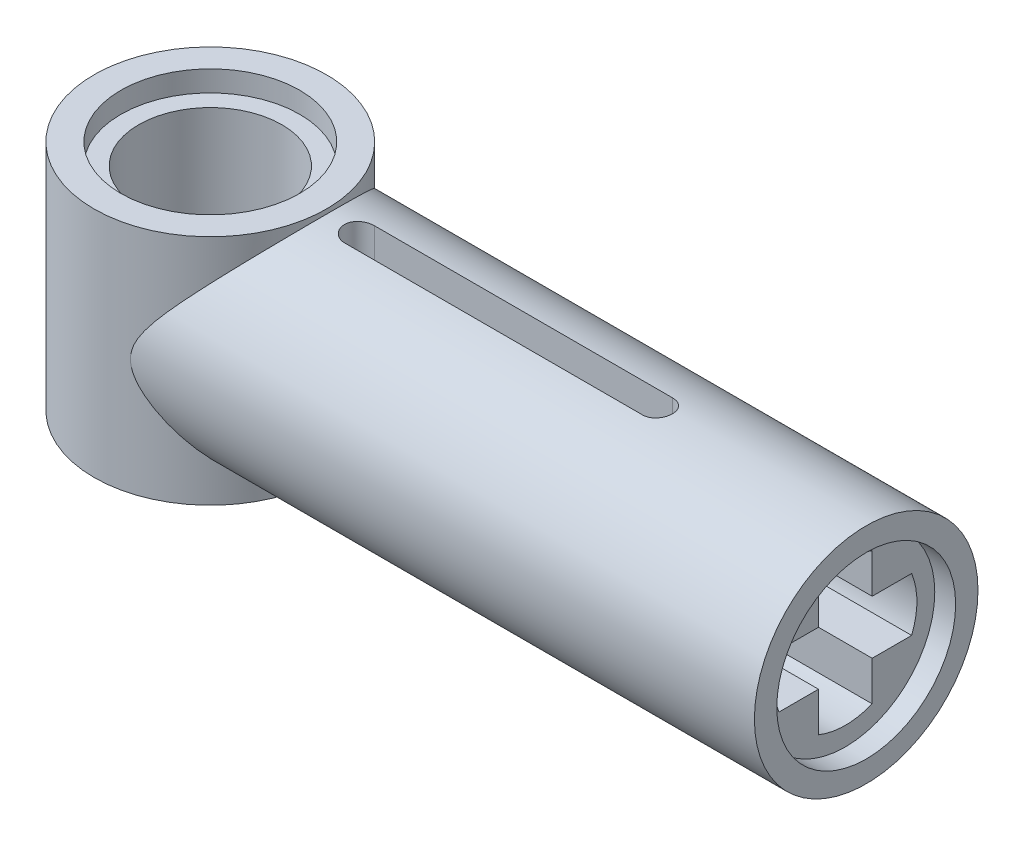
ISO-10303-21;
HEADER;
FILE_DESCRIPTION(('STEP AP214'),'2;1');
FILE_NAME('part.step','',(''),(''),'','','');
FILE_SCHEMA(('AUTOMOTIVE_DESIGN { 1 0 10303 214 1 1 1 1 }'));
ENDSEC;
DATA;
#1=APPLICATION_CONTEXT('core data for automotive mechanical design processes');
#2=APPLICATION_PROTOCOL_DEFINITION('international standard','automotive_design',2000,#1);
#3=PRODUCT_CONTEXT('',#1,'mechanical');
#4=PRODUCT('Part','Part','',(#3));
#5=PRODUCT_RELATED_PRODUCT_CATEGORY('part','',(#4));
#6=PRODUCT_DEFINITION_FORMATION('','',#4);
#7=PRODUCT_DEFINITION_CONTEXT('part definition',#1,'design');
#8=PRODUCT_DEFINITION('design','',#6,#7);
#9=PRODUCT_DEFINITION_SHAPE('','',#8);
#10=(LENGTH_UNIT() NAMED_UNIT(*) SI_UNIT(.MILLI.,.METRE.));
#11=(NAMED_UNIT(*) PLANE_ANGLE_UNIT() SI_UNIT($,.RADIAN.));
#12=(NAMED_UNIT(*) SI_UNIT($,.STERADIAN.) SOLID_ANGLE_UNIT());
#13=UNCERTAINTY_MEASURE_WITH_UNIT(LENGTH_MEASURE(1.E-05),#10,'distance_accuracy_value','');
#14=(GEOMETRIC_REPRESENTATION_CONTEXT(3) GLOBAL_UNCERTAINTY_ASSIGNED_CONTEXT((#13)) GLOBAL_UNIT_ASSIGNED_CONTEXT((#10,
#11,#12)) REPRESENTATION_CONTEXT('',''));
#15=CARTESIAN_POINT('',(0.,0.,0.));
#16=DIRECTION('',(0.,0.,1.));
#17=DIRECTION('',(1.,0.,0.));
#18=AXIS2_PLACEMENT_3D('',#15,#16,#17);
#19=CARTESIAN_POINT('',(-3.901,3.9,0.));
#20=DIRECTION('',(1.,0.,0.));
#21=DIRECTION('',(0.,0.,-1.));
#22=AXIS2_PLACEMENT_3D('',#19,#20,#21);
#23=CYLINDRICAL_SURFACE('',#22,3.75);
#24=DIRECTION('',(1.,0.,0.));
#25=VECTOR('',#24,1.);
#26=CARTESIAN_POINT('',(-3.901,7.61651718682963,0.5));
#27=LINE('',#26,#25);
#28=CARTESIAN_POINT('',(15.,7.61651718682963,0.5));
#29=VERTEX_POINT('',#28);
#30=CARTESIAN_POINT('',(5.,7.61651718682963,0.5));
#31=VERTEX_POINT('',#30);
#32=EDGE_CURVE('E198',#29,#31,#27,.F.);
#33=ORIENTED_EDGE('',*,*,#32,.T.);
#34=CARTESIAN_POINT('',(5.,7.61651718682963,0.5));
#35=CARTESIAN_POINT('',(4.97200355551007,7.61650488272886,0.500024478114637));
#36=CARTESIAN_POINT('',(4.94401708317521,7.61683319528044,0.497650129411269));
#37=CARTESIAN_POINT('',(4.88887056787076,7.6180794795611,0.48828773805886));
#38=CARTESIAN_POINT('',(4.86170964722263,7.61899680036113,0.481304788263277));
#39=CARTESIAN_POINT('',(4.80894739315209,7.62133026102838,0.46290557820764));
#40=CARTESIAN_POINT('',(4.78334654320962,7.62274655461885,0.451487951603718));
#41=CARTESIAN_POINT('',(4.73442482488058,7.62591402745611,0.424557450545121));
#42=CARTESIAN_POINT('',(4.71110381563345,7.6276651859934,0.409044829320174));
#43=CARTESIAN_POINT('',(4.66725766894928,7.63131828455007,0.374259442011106));
#44=CARTESIAN_POINT('',(4.64674884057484,7.63322101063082,0.354966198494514));
#45=CARTESIAN_POINT('',(4.60924768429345,7.63695577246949,0.313209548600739));
#46=CARTESIAN_POINT('',(4.59225589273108,7.63878779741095,0.290745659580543));
#47=CARTESIAN_POINT('',(4.56221408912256,7.6421827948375,0.24318223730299));
#48=CARTESIAN_POINT('',(4.54917910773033,7.64374473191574,0.218073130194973));
#49=CARTESIAN_POINT('',(4.5275179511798,7.64641470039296,0.165999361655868));
#50=CARTESIAN_POINT('',(4.51889133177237,7.64752277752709,0.139034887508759));
#51=CARTESIAN_POINT('',(4.5063403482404,7.64915470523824,0.0841841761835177));
#52=CARTESIAN_POINT('',(4.5023883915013,7.64968198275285,0.0563043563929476));
#53=CARTESIAN_POINT('',(4.49921332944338,7.65010462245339,0.000271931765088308));
#54=CARTESIAN_POINT('',(4.49999012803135,7.64999999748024,-0.0278806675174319));
#55=CARTESIAN_POINT('',(4.50622869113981,7.64917335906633,-0.0834701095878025));
#56=CARTESIAN_POINT('',(4.51166064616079,7.6484552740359,-0.110910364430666));
#57=CARTESIAN_POINT('',(4.52700863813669,7.64648680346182,-0.164486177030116));
#58=CARTESIAN_POINT('',(4.53692474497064,7.64523640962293,-0.190621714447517));
#59=CARTESIAN_POINT('',(4.56099110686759,7.64233701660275,-0.240938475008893));
#60=CARTESIAN_POINT('',(4.57515423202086,7.64068680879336,-0.265113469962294));
#61=CARTESIAN_POINT('',(4.60730257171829,7.63717230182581,-0.310753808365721));
#62=CARTESIAN_POINT('',(4.62528782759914,7.6353080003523,-0.3322191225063));
#63=CARTESIAN_POINT('',(4.66473404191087,7.63155673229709,-0.372004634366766));
#64=CARTESIAN_POINT('',(4.68622053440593,7.62966970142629,-0.390299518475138));
#65=CARTESIAN_POINT('',(4.73197955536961,7.62609928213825,-0.423032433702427));
#66=CARTESIAN_POINT('',(4.75625290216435,7.6244159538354,-0.437469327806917));
#67=CARTESIAN_POINT('',(4.8069279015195,7.62144269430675,-0.462079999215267));
#68=CARTESIAN_POINT('',(4.83333188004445,7.6201532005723,-0.472249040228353));
#69=CARTESIAN_POINT('',(4.88746211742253,7.61812321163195,-0.487982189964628));
#70=CARTESIAN_POINT('',(4.9151863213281,7.61738189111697,-0.493553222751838));
#71=CARTESIAN_POINT('',(4.96203862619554,7.61666156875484,-0.498921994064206));
#72=CARTESIAN_POINT('',(4.98102361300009,7.61651286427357,-0.500009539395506));
#73=CARTESIAN_POINT('',(5.,7.61651718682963,-0.5));
#74=B_SPLINE_CURVE_WITH_KNOTS('',3,(#34,#35,#36,#37,#38,#39,#40,#41,#42,#43,#44,#45,#46,#47,#48,
#49,#50,#51,#52,#53,#54,#55,#56,#57,#58,#59,#60,#61,#62,#63,#64,#65,#66,#67,#68,#69,#70,#71,#72,
#73),.UNSPECIFIED.,.F.,.F.,(4,2,2,2,2,2,2,2,2,2,2,2,2,2,2,2,2,2,2,4),(0.,0.0838721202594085,
0.167651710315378,0.251457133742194,0.335257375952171,0.419524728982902,0.503804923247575,
0.588401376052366,0.672989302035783,0.757075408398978,0.841159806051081,0.924709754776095,
1.00826100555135,1.0920680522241,1.17587600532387,1.26032502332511,1.34479890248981,
1.42936628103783,1.51380607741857,1.57072717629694),.UNSPECIFIED.);
#75=CARTESIAN_POINT('',(5.,7.61651718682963,-0.5));
#76=VERTEX_POINT('',#75);
#77=EDGE_CURVE('E190',#31,#76,#74,.T.);
#78=ORIENTED_EDGE('',*,*,#77,.T.);
#79=DIRECTION('',(1.,0.,0.));
#80=VECTOR('',#79,1.);
#81=CARTESIAN_POINT('',(-3.901,7.61651718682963,-0.5));
#82=LINE('',#81,#80);
#83=CARTESIAN_POINT('',(15.,7.61651718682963,-0.5));
#84=VERTEX_POINT('',#83);
#85=EDGE_CURVE('E177',#76,#84,#82,.T.);
#86=ORIENTED_EDGE('',*,*,#85,.T.);
#87=CARTESIAN_POINT('',(15.,7.61651718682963,-0.5));
#88=CARTESIAN_POINT('',(15.0279964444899,7.61650488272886,-0.500024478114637));
#89=CARTESIAN_POINT('',(15.0559829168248,7.61683319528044,-0.497650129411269));
#90=CARTESIAN_POINT('',(15.1111294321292,7.6180794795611,-0.48828773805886));
#91=CARTESIAN_POINT('',(15.1382903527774,7.61899680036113,-0.481304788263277));
#92=CARTESIAN_POINT('',(15.1910526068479,7.62133026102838,-0.46290557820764));
#93=CARTESIAN_POINT('',(15.2166534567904,7.62274655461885,-0.451487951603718));
#94=CARTESIAN_POINT('',(15.2655751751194,7.62591402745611,-0.424557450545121));
#95=CARTESIAN_POINT('',(15.2888961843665,7.6276651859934,-0.409044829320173));
#96=CARTESIAN_POINT('',(15.3327423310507,7.63131828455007,-0.374259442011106));
#97=CARTESIAN_POINT('',(15.3532511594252,7.63322101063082,-0.354966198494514));
#98=CARTESIAN_POINT('',(15.3907523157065,7.63695577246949,-0.313209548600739));
#99=CARTESIAN_POINT('',(15.4077441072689,7.63878779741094,-0.290745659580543));
#100=CARTESIAN_POINT('',(15.4377859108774,7.6421827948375,-0.24318223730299));
#101=CARTESIAN_POINT('',(15.4508208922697,7.64374473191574,-0.218073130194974));
#102=CARTESIAN_POINT('',(15.4724820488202,7.64641470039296,-0.165999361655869));
#103=CARTESIAN_POINT('',(15.4811086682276,7.64752277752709,-0.13903488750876));
#104=CARTESIAN_POINT('',(15.4936596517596,7.64915470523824,-0.0841841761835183));
#105=CARTESIAN_POINT('',(15.4976116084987,7.64968198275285,-0.0563043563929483));
#106=CARTESIAN_POINT('',(15.5007866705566,7.65010462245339,-0.000271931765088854));
#107=CARTESIAN_POINT('',(15.5000098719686,7.64999999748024,0.0278806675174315));
#108=CARTESIAN_POINT('',(15.4937713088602,7.64917335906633,0.0834701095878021));
#109=CARTESIAN_POINT('',(15.4883393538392,7.6484552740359,0.110910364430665));
#110=CARTESIAN_POINT('',(15.4729913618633,7.64648680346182,0.164486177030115));
#111=CARTESIAN_POINT('',(15.4630752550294,7.64523640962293,0.190621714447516));
#112=CARTESIAN_POINT('',(15.4390088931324,7.64233701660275,0.240938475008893));
#113=CARTESIAN_POINT('',(15.4248457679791,7.64068680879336,0.265113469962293));
#114=CARTESIAN_POINT('',(15.3926974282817,7.63717230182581,0.310753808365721));
#115=CARTESIAN_POINT('',(15.3747121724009,7.6353080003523,0.3322191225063));
#116=CARTESIAN_POINT('',(15.3352659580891,7.63155673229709,0.372004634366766));
#117=CARTESIAN_POINT('',(15.3137794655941,7.62966970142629,0.390299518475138));
#118=CARTESIAN_POINT('',(15.2680204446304,7.62609928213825,0.423032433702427));
#119=CARTESIAN_POINT('',(15.2437470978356,7.6244159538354,0.437469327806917));
#120=CARTESIAN_POINT('',(15.1930720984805,7.62144269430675,0.462079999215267));
#121=CARTESIAN_POINT('',(15.1666681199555,7.6201532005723,0.472249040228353));
#122=CARTESIAN_POINT('',(15.1125378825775,7.61812321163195,0.487982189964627));
#123=CARTESIAN_POINT('',(15.0848136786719,7.61738189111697,0.493553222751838));
#124=CARTESIAN_POINT('',(15.0379613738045,7.61666156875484,0.498921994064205));
#125=CARTESIAN_POINT('',(15.0189763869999,7.61651286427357,0.500009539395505));
#126=CARTESIAN_POINT('',(15.,7.61651718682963,0.5));
#127=B_SPLINE_CURVE_WITH_KNOTS('',3,(#87,#88,#89,#90,#91,#92,#93,#94,#95,#96,#97,#98,#99,#100,
#101,#102,#103,#104,#105,#106,#107,#108,#109,#110,#111,#112,#113,#114,#115,#116,#117,#118,#119,
#120,#121,#122,#123,#124,#125,#126),.UNSPECIFIED.,.F.,.F.,(4,2,2,2,2,2,2,2,2,2,2,2,2,2,2,2,2,2,
2,4),(0.,0.0838721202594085,0.167651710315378,0.251457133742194,0.335257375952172,
0.419524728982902,0.503804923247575,0.588401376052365,0.672989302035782,0.757075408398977,
0.841159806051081,0.924709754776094,1.00826100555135,1.0920680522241,1.17587600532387,
1.26032502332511,1.34479890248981,1.42936628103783,1.51380607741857,1.57072717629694),.UNSPECIFIED.);
#128=EDGE_CURVE('E281',#84,#29,#127,.T.);
#129=ORIENTED_EDGE('',*,*,#128,.T.);
#130=EDGE_LOOP('',(#33,#78,#86,#129));
#131=FACE_BOUND('',#130,.T.);
#132=CARTESIAN_POINT('',(22.,3.9,0.));
#133=DIRECTION('',(1.,0.,0.));
#134=DIRECTION('',(0.,0.,-1.));
#135=AXIS2_PLACEMENT_3D('',#132,#133,#134);
#136=CIRCLE('',#135,3.75);
#137=CARTESIAN_POINT('',(22.,3.9,-3.75));
#138=VERTEX_POINT('',#137);
#139=EDGE_CURVE('E373',#138,#138,#136,.T.);
#140=ORIENTED_EDGE('',*,*,#139,.F.);
#141=EDGE_LOOP('',(#140));
#142=FACE_BOUND('',#141,.T.);
#143=CARTESIAN_POINT('',(1.07121426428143,3.9,-3.75));
#144=CARTESIAN_POINT('',(1.0712287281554,3.96974243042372,-3.74999740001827));
#145=CARTESIAN_POINT('',(1.07819350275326,4.03951037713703,-3.74802612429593));
#146=CARTESIAN_POINT('',(1.10427443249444,4.17662272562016,-3.74042054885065));
#147=CARTESIAN_POINT('',(1.12343899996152,4.24395633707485,-3.73477165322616));
#148=CARTESIAN_POINT('',(1.18507534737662,4.41675951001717,-3.71579597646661));
#149=CARTESIAN_POINT('',(1.23461964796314,4.51929818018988,-3.69987154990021));
#150=CARTESIAN_POINT('',(1.34469296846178,4.71696550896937,-3.66132040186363));
#151=CARTESIAN_POINT('',(1.40527082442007,4.8120584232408,-3.63866358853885));
#152=CARTESIAN_POINT('',(1.54343879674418,5.01403068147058,-3.58250468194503));
#153=CARTESIAN_POINT('',(1.62210063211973,5.11982614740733,-3.5477706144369));
#154=CARTESIAN_POINT('',(1.78240750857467,5.32605282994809,-3.47001567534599));
#155=CARTESIAN_POINT('',(1.8640554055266,5.42647867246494,-3.42698669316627));
#156=CARTESIAN_POINT('',(2.02796318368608,5.62279950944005,-3.33261324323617));
#157=CARTESIAN_POINT('',(2.1102229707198,5.71869518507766,-3.28127003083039));
#158=CARTESIAN_POINT('',(2.27380971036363,5.90618946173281,-3.17010636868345));
#159=CARTESIAN_POINT('',(2.35513706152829,5.99778995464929,-3.11028969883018));
#160=CARTESIAN_POINT('',(2.51148053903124,6.17187499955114,-2.98528764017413));
#161=CARTESIAN_POINT('',(2.58660310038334,6.25458548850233,-2.92055283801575));
#162=CARTESIAN_POINT('',(2.73404323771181,6.41565859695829,-2.78301819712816));
#163=CARTESIAN_POINT('',(2.80636034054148,6.49402048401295,-2.71021700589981));
#164=CARTESIAN_POINT('',(3.01748759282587,6.72151548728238,-2.47953471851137));
#165=CARTESIAN_POINT('',(3.15088369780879,6.86350897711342,-2.30905781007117));
#166=CARTESIAN_POINT('',(3.36124117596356,7.08611895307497,-1.9846350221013));
#167=CARTESIAN_POINT('',(3.44373852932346,7.17297861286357,-1.83854023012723));
#168=CARTESIAN_POINT('',(3.59185298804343,7.32848003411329,-1.52901857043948));
#169=CARTESIAN_POINT('',(3.65749063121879,7.39714396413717,-1.36561313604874));
#170=CARTESIAN_POINT('',(3.75914914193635,7.50331749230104,-1.04978957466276));
#171=CARTESIAN_POINT('',(3.79813171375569,7.54395108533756,-0.899384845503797));
#172=CARTESIAN_POINT('',(3.85811206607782,7.60642773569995,-0.591229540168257));
#173=CARTESIAN_POINT('',(3.87912016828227,7.62828157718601,-0.433483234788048));
#174=CARTESIAN_POINT('',(3.9015999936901,7.65166536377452,-0.11459881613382));
#175=CARTESIAN_POINT('',(3.9030130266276,7.65313425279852,0.0465480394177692));
#176=CARTESIAN_POINT('',(3.88603515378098,7.63547520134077,0.366644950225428));
#177=CARTESIAN_POINT('',(3.8676417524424,7.61634466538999,0.525594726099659));
#178=CARTESIAN_POINT('',(3.81373510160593,7.56020944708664,0.829579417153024));
#179=CARTESIAN_POINT('',(3.77902940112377,7.52404774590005,0.974918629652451));
#180=CARTESIAN_POINT('',(3.69501493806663,7.43635299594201,1.2563727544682));
#181=CARTESIAN_POINT('',(3.64570101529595,7.38481451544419,1.3924843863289));
#182=CARTESIAN_POINT('',(3.51322336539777,7.24601610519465,1.70475006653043));
#183=CARTESIAN_POINT('',(3.42436162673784,7.15266649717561,1.87577867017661));
#184=CARTESIAN_POINT('',(3.22922609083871,6.94655802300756,2.19481969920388));
#185=CARTESIAN_POINT('',(3.12291324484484,6.83375559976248,2.34277902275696));
#186=CARTESIAN_POINT('',(2.93410795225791,6.6317272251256,2.57206169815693));
#187=CARTESIAN_POINT('',(2.85480376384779,6.54642458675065,2.65960528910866));
#188=CARTESIAN_POINT('',(2.69201375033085,6.36993979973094,2.82426336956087));
#189=CARTESIAN_POINT('',(2.6085277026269,6.27875733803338,2.90137730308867));
#190=CARTESIAN_POINT('',(2.4386774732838,6.09117483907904,3.04553112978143));
#191=CARTESIAN_POINT('',(2.35231175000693,5.99477198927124,3.11256551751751));
#192=CARTESIAN_POINT('',(2.17818376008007,5.7971435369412,3.23681322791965));
#193=CARTESIAN_POINT('',(2.0904220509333,5.69591982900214,3.29403036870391));
#194=CARTESIAN_POINT('',(1.90080524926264,5.47157367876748,3.40748894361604));
#195=CARTESIAN_POINT('',(1.7989795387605,5.34756723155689,3.4620580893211));
#196=CARTESIAN_POINT('',(1.64980006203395,5.1553585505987,3.53429348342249));
#197=CARTESIAN_POINT('',(1.60069071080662,5.09029032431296,3.55675995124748));
#198=CARTESIAN_POINT('',(1.5046210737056,4.95758895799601,3.59845064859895));
#199=CARTESIAN_POINT('',(1.45766000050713,4.88995677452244,3.61767607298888));
#200=CARTESIAN_POINT('',(1.36424839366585,4.74666576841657,3.65397045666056));
#201=CARTESIAN_POINT('',(1.31805603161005,4.67077498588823,3.67079952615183));
#202=CARTESIAN_POINT('',(1.23298798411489,4.51408080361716,3.70023665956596));
#203=CARTESIAN_POINT('',(1.19410687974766,4.43328110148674,3.71284785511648));
#204=CARTESIAN_POINT('',(1.13812997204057,4.28855818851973,3.7303198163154));
#205=CARTESIAN_POINT('',(1.11798571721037,4.22599935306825,3.73635490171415));
#206=CARTESIAN_POINT('',(1.0876823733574,4.09837834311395,3.74529118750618));
#207=CARTESIAN_POINT('',(1.07748849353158,4.03332572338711,3.74820331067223));
#208=CARTESIAN_POINT('',(1.06919702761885,3.90179888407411,3.75057935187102));
#209=CARTESIAN_POINT('',(1.07119863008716,3.83531740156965,3.75001499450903));
#210=CARTESIAN_POINT('',(1.0870480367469,3.70385921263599,3.74544838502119));
#211=CARTESIAN_POINT('',(1.10092333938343,3.63888635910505,3.7414381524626));
#212=CARTESIAN_POINT('',(1.14608517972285,3.48298826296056,3.72789971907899));
#213=CARTESIAN_POINT('',(1.18242712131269,3.39374632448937,3.71668878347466));
#214=CARTESIAN_POINT('',(1.26590820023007,3.22120256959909,3.6890964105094));
#215=CARTESIAN_POINT('',(1.31310133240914,3.1379332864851,3.67268895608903));
#216=CARTESIAN_POINT('',(1.43636212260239,2.93856703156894,3.62669719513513));
#217=CARTESIAN_POINT('',(1.51568303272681,2.82511793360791,3.59452910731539));
#218=CARTESIAN_POINT('',(1.67922593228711,2.60476754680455,3.52112666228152));
#219=CARTESIAN_POINT('',(1.76345637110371,2.49787823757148,3.47987631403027));
#220=CARTESIAN_POINT('',(1.93365536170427,2.28904441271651,3.3882649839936));
#221=CARTESIAN_POINT('',(2.0196275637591,2.18711223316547,3.33788261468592));
#222=CARTESIAN_POINT('',(2.19104004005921,1.98801236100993,3.22795916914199));
#223=CARTESIAN_POINT('',(2.27648066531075,1.8908411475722,3.1684249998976));
#224=CARTESIAN_POINT('',(2.44883848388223,1.69743193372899,3.03732845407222));
#225=CARTESIAN_POINT('',(2.53568005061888,1.60138345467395,2.96538296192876));
#226=CARTESIAN_POINT('',(2.70589697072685,1.41488059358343,2.81093683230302));
#227=CARTESIAN_POINT('',(2.7892709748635,1.32442838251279,2.72843213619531));
#228=CARTESIAN_POINT('',(3.03147428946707,1.06334761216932,2.46510666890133));
#229=CARTESIAN_POINT('',(3.18334621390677,0.901934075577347,2.26777468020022));
#230=CARTESIAN_POINT('',(3.40295246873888,0.669928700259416,1.91196175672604));
#231=CARTESIAN_POINT('',(3.48078260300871,0.58807795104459,1.767019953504));
#232=CARTESIAN_POINT('',(3.58509377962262,0.478666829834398,1.53758660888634));
#233=CARTESIAN_POINT('',(3.61780053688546,0.444414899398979,1.45907760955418));
#234=CARTESIAN_POINT('',(3.67854061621,0.380874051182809,1.29834977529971));
#235=CARTESIAN_POINT('',(3.70657587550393,0.351583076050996,1.21613249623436));
#236=CARTESIAN_POINT('',(3.75772518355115,0.298186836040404,1.04753940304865));
#237=CARTESIAN_POINT('',(3.78078667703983,0.274136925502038,0.961129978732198));
#238=CARTESIAN_POINT('',(3.82112359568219,0.232095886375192,0.785569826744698));
#239=CARTESIAN_POINT('',(3.83840215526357,0.2141014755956,0.696420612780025));
#240=CARTESIAN_POINT('',(3.86677145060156,0.184567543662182,0.516138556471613));
#241=CARTESIAN_POINT('',(3.87786588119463,0.173024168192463,0.425006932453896));
#242=CARTESIAN_POINT('',(3.89359743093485,0.156658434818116,0.241594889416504));
#243=CARTESIAN_POINT('',(3.89823554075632,0.151835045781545,0.149314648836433));
#244=CARTESIAN_POINT('',(3.90074734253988,0.149222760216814,-0.0227131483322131));
#245=CARTESIAN_POINT('',(3.89946460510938,0.150556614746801,-0.102436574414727));
#246=CARTESIAN_POINT('',(3.89204420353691,0.15827461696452,-0.261418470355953));
#247=CARTESIAN_POINT('',(3.88590502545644,0.164660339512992,-0.340676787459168));
#248=CARTESIAN_POINT('',(3.86034813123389,0.191251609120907,-0.576778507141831));
#249=CARTESIAN_POINT('',(3.8337932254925,0.218888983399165,-0.732121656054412));
#250=CARTESIAN_POINT('',(3.76450101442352,0.291112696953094,-1.03024529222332));
#251=CARTESIAN_POINT('',(3.72221294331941,0.335228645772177,-1.17325003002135));
#252=CARTESIAN_POINT('',(3.62385633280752,0.43805563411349,-1.44882285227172));
#253=CARTESIAN_POINT('',(3.56778345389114,0.496771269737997,-1.58138763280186));
#254=CARTESIAN_POINT('',(3.41620683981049,0.655958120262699,-1.89251516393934));
#255=CARTESIAN_POINT('',(3.3143799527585,0.763263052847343,-2.06450241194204));
#256=CARTESIAN_POINT('',(3.09369008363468,0.997418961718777,-2.38259092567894));
#257=CARTESIAN_POINT('',(2.97478076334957,1.12432317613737,-2.5286192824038));
#258=CARTESIAN_POINT('',(2.76581836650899,1.34982015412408,-2.75237860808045));
#259=CARTESIAN_POINT('',(2.67872032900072,1.44446334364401,-2.83700465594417));
#260=CARTESIAN_POINT('',(2.50091339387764,1.63975405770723,-2.99492422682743));
#261=CARTESIAN_POINT('',(2.41020261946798,1.74040471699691,-3.06821176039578));
#262=CARTESIAN_POINT('',(2.22691416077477,1.94707148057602,-3.20372159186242));
#263=CARTESIAN_POINT('',(2.13433806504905,2.05308312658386,-3.26595289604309));
#264=CARTESIAN_POINT('',(1.94916335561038,2.27057054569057,-3.37972360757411));
#265=CARTESIAN_POINT('',(1.85656479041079,2.3820429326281,-3.43126953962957));
#266=CARTESIAN_POINT('',(1.68972517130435,2.59194965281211,-3.51596919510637));
#267=CARTESIAN_POINT('',(1.61504153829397,2.68937492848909,-3.55076005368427));
#268=CARTESIAN_POINT('',(1.4705206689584,2.89010845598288,-3.61298937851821));
#269=CARTESIAN_POINT('',(1.40068112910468,2.993413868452,-3.64043135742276));
#270=CARTESIAN_POINT('',(1.29331705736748,3.17304026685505,-3.67960010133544));
#271=CARTESIAN_POINT('',(1.25273278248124,3.24702009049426,-3.69352468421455));
#272=CARTESIAN_POINT('',(1.1803220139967,3.39982957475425,-3.71729473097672));
#273=CARTESIAN_POINT('',(1.14847557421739,3.47864767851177,-3.72714951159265));
#274=CARTESIAN_POINT('',(1.10725509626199,3.61497315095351,-3.73955896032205));
#275=CARTESIAN_POINT('',(1.0939442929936,3.67113009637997,-3.74344376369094));
#276=CARTESIAN_POINT('',(1.0759281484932,3.7848546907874,-3.74866232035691));
#277=CARTESIAN_POINT('',(1.07120232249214,3.84241864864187,-3.7500021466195));
#278=CARTESIAN_POINT('',(1.07121426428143,3.9,-3.75));
#279=B_SPLINE_CURVE_WITH_KNOTS('',3,(#143,#144,#145,#146,#147,#148,#149,#150,#151,#152,#153,
#154,#155,#156,#157,#158,#159,#160,#161,#162,#163,#164,#165,#166,#167,#168,#169,#170,#171,#172,
#173,#174,#175,#176,#177,#178,#179,#180,#181,#182,#183,#184,#185,#186,#187,#188,#189,#190,#191,
#192,#193,#194,#195,#196,#197,#198,#199,#200,#201,#202,#203,#204,#205,#206,#207,#208,#209,#210,
#211,#212,#213,#214,#215,#216,#217,#218,#219,#220,#221,#222,#223,#224,#225,#226,#227,#228,#229,
#230,#231,#232,#233,#234,#235,#236,#237,#238,#239,#240,#241,#242,#243,#244,#245,#246,#247,#248,
#249,#250,#251,#252,#253,#254,#255,#256,#257,#258,#259,#260,#261,#262,#263,#264,#265,#266,#267,
#268,#269,#270,#271,#272,#273,#274,#275,#276,#277,#278),.UNSPECIFIED.,.T.,.F.,(4,2,2,2,2,2,2,2,
2,2,2,2,2,2,2,2,2,2,2,2,2,2,2,2,2,2,2,2,2,2,2,2,2,2,2,2,2,2,2,2,2,2,2,2,2,2,2,2,2,2,2,2,2,2,2,2,
2,2,2,2,2,2,2,2,2,2,2,4),(0.,0.208968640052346,0.418771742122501,0.761784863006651,
1.10635482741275,1.51481449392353,1.92367558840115,2.33247500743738,2.74109263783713,
3.12812270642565,3.51521776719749,4.28736681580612,4.8521979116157,5.4163376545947,
5.89608121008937,6.37554909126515,6.85645274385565,7.33741699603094,7.79674018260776,
8.256225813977,8.89518434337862,9.53559260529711,9.9721703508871,10.4087713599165,
10.845609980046,11.2822783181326,11.7899687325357,12.0435573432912,12.2970522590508,
12.5680152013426,12.8387765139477,13.0361223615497,13.2327757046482,13.4310305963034,
13.6297458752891,13.9191194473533,14.2099653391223,14.6354514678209,15.0616928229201,
15.4889456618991,15.9158776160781,16.3597252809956,16.8037440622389,17.6870602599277,
18.2362489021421,18.5110238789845,18.7856846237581,19.0631189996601,19.340402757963,
19.617520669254,19.8945960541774,20.1335153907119,20.3725092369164,20.8499850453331,
21.3147601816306,21.7796818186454,22.4565182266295,23.1352265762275,23.5965656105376,
24.0581475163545,24.519351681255,24.9802733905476,25.3627647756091,25.7450730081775,
26.0012560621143,26.2568493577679,26.4297930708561,26.602323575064),.UNSPECIFIED.);
#280=CARTESIAN_POINT('',(1.07121426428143,3.9,-3.75));
#281=VERTEX_POINT('',#280);
#282=EDGE_CURVE('E366',#281,#281,#279,.T.);
#283=ORIENTED_EDGE('',*,*,#282,.T.);
#284=EDGE_LOOP('',(#283));
#285=FACE_BOUND('',#284,.T.);
#286=DIRECTION('',(1.,0.,0.));
#287=VECTOR('',#286,1.);
#288=CARTESIAN_POINT('',(-3.901,0.183482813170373,-0.5));
#289=LINE('',#288,#287);
#290=CARTESIAN_POINT('',(15.,0.183482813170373,-0.5));
#291=VERTEX_POINT('',#290);
#292=CARTESIAN_POINT('',(5.,0.183482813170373,-0.5));
#293=VERTEX_POINT('',#292);
#294=EDGE_CURVE('E184',#291,#293,#289,.F.);
#295=ORIENTED_EDGE('',*,*,#294,.T.);
#296=CARTESIAN_POINT('',(5.,0.183482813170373,-0.5));
#297=CARTESIAN_POINT('',(4.97200355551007,0.183495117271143,-0.500024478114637));
#298=CARTESIAN_POINT('',(4.94401708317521,0.183166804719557,-0.497650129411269));
#299=CARTESIAN_POINT('',(4.88887056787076,0.181920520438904,-0.48828773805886));
#300=CARTESIAN_POINT('',(4.86170964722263,0.181003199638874,-0.481304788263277));
#301=CARTESIAN_POINT('',(4.80894739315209,0.178669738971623,-0.46290557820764));
#302=CARTESIAN_POINT('',(4.78334654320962,0.177253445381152,-0.451487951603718));
#303=CARTESIAN_POINT('',(4.73442482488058,0.17408597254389,-0.424557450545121));
#304=CARTESIAN_POINT('',(4.71110381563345,0.172334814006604,-0.409044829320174));
#305=CARTESIAN_POINT('',(4.66725766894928,0.168681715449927,-0.374259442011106));
#306=CARTESIAN_POINT('',(4.64674884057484,0.166778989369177,-0.354966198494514));
#307=CARTESIAN_POINT('',(4.60924768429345,0.163044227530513,-0.313209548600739));
#308=CARTESIAN_POINT('',(4.59225589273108,0.161212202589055,-0.290745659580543));
#309=CARTESIAN_POINT('',(4.56221408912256,0.1578172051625,-0.24318223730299));
#310=CARTESIAN_POINT('',(4.54917910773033,0.156255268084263,-0.218073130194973));
#311=CARTESIAN_POINT('',(4.5275179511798,0.153585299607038,-0.165999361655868));
#312=CARTESIAN_POINT('',(4.51889133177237,0.152477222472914,-0.139034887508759));
#313=CARTESIAN_POINT('',(4.5063403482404,0.150845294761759,-0.0841841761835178));
#314=CARTESIAN_POINT('',(4.5023883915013,0.150318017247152,-0.0563043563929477));
#315=CARTESIAN_POINT('',(4.49921332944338,0.149895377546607,-0.000271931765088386));
#316=CARTESIAN_POINT('',(4.49999012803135,0.150000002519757,0.0278806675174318));
#317=CARTESIAN_POINT('',(4.50622869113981,0.150826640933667,0.0834701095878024));
#318=CARTESIAN_POINT('',(4.51166064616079,0.151544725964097,0.110910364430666));
#319=CARTESIAN_POINT('',(4.52700863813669,0.153513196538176,0.164486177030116));
#320=CARTESIAN_POINT('',(4.53692474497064,0.15476359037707,0.190621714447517));
#321=CARTESIAN_POINT('',(4.56099110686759,0.157662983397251,0.240938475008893));
#322=CARTESIAN_POINT('',(4.57515423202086,0.159313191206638,0.265113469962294));
#323=CARTESIAN_POINT('',(4.60730257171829,0.162827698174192,0.310753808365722));
#324=CARTESIAN_POINT('',(4.62528782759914,0.164691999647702,0.3322191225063));
#325=CARTESIAN_POINT('',(4.66473404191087,0.168443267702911,0.372004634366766));
#326=CARTESIAN_POINT('',(4.68622053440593,0.170330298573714,0.390299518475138));
#327=CARTESIAN_POINT('',(4.73197955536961,0.173900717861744,0.423032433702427));
#328=CARTESIAN_POINT('',(4.75625290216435,0.175584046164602,0.437469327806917));
#329=CARTESIAN_POINT('',(4.8069279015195,0.178557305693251,0.462079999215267));
#330=CARTESIAN_POINT('',(4.83333188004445,0.179846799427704,0.472249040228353));
#331=CARTESIAN_POINT('',(4.88746211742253,0.181876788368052,0.487982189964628));
#332=CARTESIAN_POINT('',(4.9151863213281,0.182618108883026,0.493553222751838));
#333=CARTESIAN_POINT('',(4.96203862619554,0.183338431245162,0.498921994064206));
#334=CARTESIAN_POINT('',(4.98102361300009,0.183487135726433,0.500009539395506));
#335=CARTESIAN_POINT('',(5.,0.183482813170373,0.5));
#336=B_SPLINE_CURVE_WITH_KNOTS('',3,(#296,#297,#298,#299,#300,#301,#302,#303,#304,#305,#306,
#307,#308,#309,#310,#311,#312,#313,#314,#315,#316,#317,#318,#319,#320,#321,#322,#323,#324,#325,
#326,#327,#328,#329,#330,#331,#332,#333,#334,#335),.UNSPECIFIED.,.F.,.F.,(4,2,2,2,2,2,2,2,2,2,2,
2,2,2,2,2,2,2,2,4),(0.,0.0838721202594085,0.167651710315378,0.251457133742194,0.335257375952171,
0.419524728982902,0.503804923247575,0.588401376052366,0.672989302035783,0.757075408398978,
0.841159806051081,0.924709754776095,1.00826100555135,1.0920680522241,1.17587600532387,
1.26032502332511,1.34479890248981,1.42936628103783,1.51380607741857,1.57072717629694),.UNSPECIFIED.);
#337=CARTESIAN_POINT('',(5.,0.183482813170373,0.5));
#338=VERTEX_POINT('',#337);
#339=EDGE_CURVE('E199',#293,#338,#336,.T.);
#340=ORIENTED_EDGE('',*,*,#339,.T.);
#341=DIRECTION('',(1.,0.,0.));
#342=VECTOR('',#341,1.);
#343=CARTESIAN_POINT('',(-3.901,0.183482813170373,0.5));
#344=LINE('',#343,#342);
#345=CARTESIAN_POINT('',(15.,0.183482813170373,0.5));
#346=VERTEX_POINT('',#345);
#347=EDGE_CURVE('E293',#338,#346,#344,.T.);
#348=ORIENTED_EDGE('',*,*,#347,.T.);
#349=CARTESIAN_POINT('',(15.,0.183482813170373,0.5));
#350=CARTESIAN_POINT('',(15.0279964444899,0.183495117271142,0.500024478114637));
#351=CARTESIAN_POINT('',(15.0559829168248,0.183166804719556,0.497650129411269));
#352=CARTESIAN_POINT('',(15.1111294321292,0.181920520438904,0.48828773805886));
#353=CARTESIAN_POINT('',(15.1382903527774,0.181003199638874,0.481304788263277));
#354=CARTESIAN_POINT('',(15.1910526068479,0.178669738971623,0.46290557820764));
#355=CARTESIAN_POINT('',(15.2166534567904,0.177253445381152,0.451487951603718));
#356=CARTESIAN_POINT('',(15.2655751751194,0.17408597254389,0.424557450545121));
#357=CARTESIAN_POINT('',(15.2888961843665,0.172334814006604,0.409044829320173));
#358=CARTESIAN_POINT('',(15.3327423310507,0.168681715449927,0.374259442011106));
#359=CARTESIAN_POINT('',(15.3532511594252,0.166778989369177,0.354966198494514));
#360=CARTESIAN_POINT('',(15.3907523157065,0.163044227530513,0.313209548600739));
#361=CARTESIAN_POINT('',(15.4077441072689,0.161212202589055,0.290745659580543));
#362=CARTESIAN_POINT('',(15.4377859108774,0.1578172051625,0.24318223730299));
#363=CARTESIAN_POINT('',(15.4508208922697,0.156255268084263,0.218073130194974));
#364=CARTESIAN_POINT('',(15.4724820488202,0.153585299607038,0.165999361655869));
#365=CARTESIAN_POINT('',(15.4811086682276,0.152477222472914,0.13903488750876));
#366=CARTESIAN_POINT('',(15.4936596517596,0.150845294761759,0.0841841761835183));
#367=CARTESIAN_POINT('',(15.4976116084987,0.150318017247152,0.0563043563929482));
#368=CARTESIAN_POINT('',(15.5007866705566,0.149895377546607,0.000271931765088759));
#369=CARTESIAN_POINT('',(15.5000098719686,0.150000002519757,-0.0278806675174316));
#370=CARTESIAN_POINT('',(15.4937713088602,0.150826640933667,-0.0834701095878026));
#371=CARTESIAN_POINT('',(15.4883393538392,0.151544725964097,-0.110910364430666));
#372=CARTESIAN_POINT('',(15.4729913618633,0.153513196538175,-0.164486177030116));
#373=CARTESIAN_POINT('',(15.4630752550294,0.15476359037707,-0.190621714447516));
#374=CARTESIAN_POINT('',(15.4390088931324,0.157662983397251,-0.240938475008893));
#375=CARTESIAN_POINT('',(15.4248457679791,0.159313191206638,-0.265113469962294));
#376=CARTESIAN_POINT('',(15.3926974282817,0.162827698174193,-0.310753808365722));
#377=CARTESIAN_POINT('',(15.3747121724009,0.164691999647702,-0.3322191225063));
#378=CARTESIAN_POINT('',(15.3352659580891,0.168443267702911,-0.372004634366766));
#379=CARTESIAN_POINT('',(15.3137794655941,0.170330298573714,-0.390299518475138));
#380=CARTESIAN_POINT('',(15.2680204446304,0.173900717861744,-0.423032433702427));
#381=CARTESIAN_POINT('',(15.2437470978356,0.175584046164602,-0.437469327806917));
#382=CARTESIAN_POINT('',(15.1930720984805,0.178557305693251,-0.462079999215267));
#383=CARTESIAN_POINT('',(15.1666681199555,0.179846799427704,-0.472249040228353));
#384=CARTESIAN_POINT('',(15.1125378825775,0.181876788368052,-0.487982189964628));
#385=CARTESIAN_POINT('',(15.0848136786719,0.182618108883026,-0.493553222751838));
#386=CARTESIAN_POINT('',(15.0379613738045,0.183338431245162,-0.498921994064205));
#387=CARTESIAN_POINT('',(15.0189763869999,0.183487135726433,-0.500009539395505));
#388=CARTESIAN_POINT('',(15.,0.183482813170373,-0.5));
#389=B_SPLINE_CURVE_WITH_KNOTS('',3,(#349,#350,#351,#352,#353,#354,#355,#356,#357,#358,#359,
#360,#361,#362,#363,#364,#365,#366,#367,#368,#369,#370,#371,#372,#373,#374,#375,#376,#377,#378,
#379,#380,#381,#382,#383,#384,#385,#386,#387,#388),.UNSPECIFIED.,.F.,.F.,(4,2,2,2,2,2,2,2,2,2,2,
2,2,2,2,2,2,2,2,4),(0.,0.0838721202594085,0.167651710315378,0.251457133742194,0.335257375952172,
0.419524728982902,0.503804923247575,0.588401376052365,0.672989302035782,0.757075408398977,
0.841159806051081,0.924709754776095,1.00826100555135,1.0920680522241,1.17587600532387,
1.26032502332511,1.34479890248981,1.42936628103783,1.51380607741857,1.57072717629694),.UNSPECIFIED.);
#390=EDGE_CURVE('E285',#346,#291,#389,.T.);
#391=ORIENTED_EDGE('',*,*,#390,.T.);
#392=EDGE_LOOP('',(#295,#340,#348,#391));
#393=FACE_BOUND('',#392,.T.);
#394=ADVANCED_FACE('F37',(#131,#142,#285,#393),#23,.T.);
#395=CARTESIAN_POINT('',(3.,3.9,0.));
#396=DIRECTION('',(1.,0.,0.));
#397=DIRECTION('',(0.,0.,-1.));
#398=AXIS2_PLACEMENT_3D('',#395,#396,#397);
#399=CYLINDRICAL_SURFACE('',#398,2.4);
#400=CARTESIAN_POINT('',(21.3,3.9,0.));
#401=DIRECTION('',(1.,0.,0.));
#402=DIRECTION('',(0.,0.,-1.));
#403=AXIS2_PLACEMENT_3D('',#400,#401,#402);
#404=CIRCLE('',#403,2.4);
#405=CARTESIAN_POINT('',(21.3,1.6751404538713,-0.900000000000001));
#406=VERTEX_POINT('',#405);
#407=CARTESIAN_POINT('',(21.3,1.6751404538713,0.899999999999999));
#408=VERTEX_POINT('',#407);
#409=EDGE_CURVE('E492',#406,#408,#404,.F.);
#410=ORIENTED_EDGE('',*,*,#409,.F.);
#411=DIRECTION('',(1.,0.,0.));
#412=VECTOR('',#411,1.);
#413=CARTESIAN_POINT('',(3.,1.6751404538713,-0.900000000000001));
#414=LINE('',#413,#412);
#415=CARTESIAN_POINT('',(3.,1.6751404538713,-0.900000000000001));
#416=VERTEX_POINT('',#415);
#417=EDGE_CURVE('E434',#416,#406,#414,.T.);
#418=ORIENTED_EDGE('',*,*,#417,.F.);
#419=CARTESIAN_POINT('',(3.,3.9,0.));
#420=DIRECTION('',(1.,0.,0.));
#421=DIRECTION('',(0.,0.,-1.));
#422=AXIS2_PLACEMENT_3D('',#419,#420,#421);
#423=CIRCLE('',#422,2.4);
#424=CARTESIAN_POINT('',(3.,1.6751404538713,0.899999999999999));
#425=VERTEX_POINT('',#424);
#426=EDGE_CURVE('E467',#425,#416,#423,.T.);
#427=ORIENTED_EDGE('',*,*,#426,.F.);
#428=DIRECTION('',(1.,0.,0.));
#429=VECTOR('',#428,1.);
#430=CARTESIAN_POINT('',(3.,1.6751404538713,0.899999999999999));
#431=LINE('',#430,#429);
#432=EDGE_CURVE('E431',#425,#408,#431,.T.);
#433=ORIENTED_EDGE('',*,*,#432,.T.);
#434=EDGE_LOOP('',(#410,#418,#427,#433));
#435=FACE_BOUND('',#434,.T.);
#436=CARTESIAN_POINT('',(5.,1.5526610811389,-0.5));
#437=CARTESIAN_POINT('',(4.97219498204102,1.55268054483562,-0.500025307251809));
#438=CARTESIAN_POINT('',(4.94440410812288,1.55216755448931,-0.497682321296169));
#439=CARTESIAN_POINT('',(4.88966449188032,1.55022314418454,-0.48845498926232));
#440=CARTESIAN_POINT('',(4.86271444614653,1.54879322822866,-0.481578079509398));
#441=CARTESIAN_POINT('',(4.81037223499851,1.5451604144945,-0.463476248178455));
#442=CARTESIAN_POINT('',(4.78498019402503,1.54295745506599,-0.452250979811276));
#443=CARTESIAN_POINT('',(4.73643440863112,1.53803375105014,-0.425790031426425));
#444=CARTESIAN_POINT('',(4.71328095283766,1.53531293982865,-0.410553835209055));
#445=CARTESIAN_POINT('',(4.66952267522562,1.52961248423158,-0.376255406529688));
#446=CARTESIAN_POINT('',(4.64895691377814,1.52662981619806,-0.357143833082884));
#447=CARTESIAN_POINT('',(4.61129700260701,1.52076834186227,-0.315742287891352));
#448=CARTESIAN_POINT('',(4.59420339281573,1.51788955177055,-0.293451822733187));
#449=CARTESIAN_POINT('',(4.56382122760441,1.51252739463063,-0.246064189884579));
#450=CARTESIAN_POINT('',(4.55057027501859,1.51004803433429,-0.220942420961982));
#451=CARTESIAN_POINT('',(4.52849310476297,1.50579851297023,-0.168769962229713));
#452=CARTESIAN_POINT('',(4.51966620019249,1.50402824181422,-0.141719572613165));
#453=CARTESIAN_POINT('',(4.50680976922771,1.50141765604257,-0.086865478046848));
#454=CARTESIAN_POINT('',(4.5027136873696,1.50056445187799,-0.0590779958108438));
#455=CARTESIAN_POINT('',(4.49922730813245,1.4998395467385,-0.00319738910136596));
#456=CARTESIAN_POINT('',(4.49983662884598,1.49996776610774,0.0248957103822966));
#457=CARTESIAN_POINT('',(4.50569385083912,1.50118136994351,0.0801307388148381));
#458=CARTESIAN_POINT('',(4.51086992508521,1.50225193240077,0.107280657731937));
#459=CARTESIAN_POINT('',(4.5255995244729,1.50521313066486,0.160317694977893));
#460=CARTESIAN_POINT('',(4.5351532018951,1.50710379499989,0.186204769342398));
#461=CARTESIAN_POINT('',(4.55843219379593,1.51151696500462,0.236184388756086));
#462=CARTESIAN_POINT('',(4.57218531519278,1.51404366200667,0.260263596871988));
#463=CARTESIAN_POINT('',(4.60345177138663,1.51945088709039,0.305798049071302));
#464=CARTESIAN_POINT('',(4.62096545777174,1.52233144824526,0.327253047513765));
#465=CARTESIAN_POINT('',(4.65964607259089,1.52819282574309,0.367355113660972));
#466=CARTESIAN_POINT('',(4.68087544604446,1.53117450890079,0.385941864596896));
#467=CARTESIAN_POINT('',(4.72618709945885,1.53685181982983,0.419306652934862));
#468=CARTESIAN_POINT('',(4.7502701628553,1.53954736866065,0.434083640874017));
#469=CARTESIAN_POINT('',(4.80070052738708,1.54434965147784,0.459433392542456));
#470=CARTESIAN_POINT('',(4.82705447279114,1.54645457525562,0.469993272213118));
#471=CARTESIAN_POINT('',(4.88119993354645,1.54981121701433,0.486502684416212));
#472=CARTESIAN_POINT('',(4.90898924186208,1.55106420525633,0.49245908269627));
#473=CARTESIAN_POINT('',(4.94750308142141,1.55209763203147,0.497348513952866));
#474=CARTESIAN_POINT('',(4.95798580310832,1.55230867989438,0.498343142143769));
#475=CARTESIAN_POINT('',(4.97897742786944,1.5525902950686,0.499668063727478));
#476=CARTESIAN_POINT('',(4.9894862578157,1.55266109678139,0.499999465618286));
#477=CARTESIAN_POINT('',(5.,1.55266108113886,0.500000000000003));
#478=B_SPLINE_CURVE_WITH_KNOTS('',3,(#436,#437,#438,#439,#440,#441,#442,#443,#444,#445,#446,
#447,#448,#449,#450,#451,#452,#453,#454,#455,#456,#457,#458,#459,#460,#461,#462,#463,#464,#465,
#466,#467,#468,#469,#470,#471,#472,#473,#474,#475,#476,#477),.UNSPECIFIED.,.F.,.F.,(4,2,2,2,2,2,
2,2,2,2,2,2,2,2,2,2,2,2,2,2,4),(0.,0.0832902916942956,0.166444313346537,0.249604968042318,
0.332776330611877,0.417081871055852,0.501400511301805,0.586518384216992,0.671623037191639,
0.755515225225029,0.839400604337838,0.921989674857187,1.00458161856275,1.08773276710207,
1.17089169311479,1.25561273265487,1.34035708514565,1.42535840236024,1.51023270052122,
1.54181150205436,1.57333747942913),.UNSPECIFIED.);
#479=CARTESIAN_POINT('',(5.,1.5526610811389,-0.5));
#480=VERTEX_POINT('',#479);
#481=CARTESIAN_POINT('',(5.,1.5526610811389,0.5));
#482=VERTEX_POINT('',#481);
#483=EDGE_CURVE('E200',#480,#482,#478,.T.);
#484=ORIENTED_EDGE('',*,*,#483,.F.);
#485=DIRECTION('',(1.,0.,0.));
#486=VECTOR('',#485,1.);
#487=CARTESIAN_POINT('',(3.,1.5526610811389,-0.5));
#488=LINE('',#487,#486);
#489=CARTESIAN_POINT('',(15.,1.5526610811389,-0.5));
#490=VERTEX_POINT('',#489);
#491=EDGE_CURVE('E185',#490,#480,#488,.F.);
#492=ORIENTED_EDGE('',*,*,#491,.F.);
#493=CARTESIAN_POINT('',(15.,1.5526610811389,0.5));
#494=CARTESIAN_POINT('',(15.027805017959,1.55268054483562,0.500025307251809));
#495=CARTESIAN_POINT('',(15.0555958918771,1.55216755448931,0.497682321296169));
#496=CARTESIAN_POINT('',(15.1103355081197,1.55022314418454,0.48845498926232));
#497=CARTESIAN_POINT('',(15.1372855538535,1.54879322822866,0.481578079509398));
#498=CARTESIAN_POINT('',(15.1896277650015,1.5451604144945,0.463476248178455));
#499=CARTESIAN_POINT('',(15.215019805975,1.54295745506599,0.452250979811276));
#500=CARTESIAN_POINT('',(15.2635655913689,1.53803375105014,0.425790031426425));
#501=CARTESIAN_POINT('',(15.2867190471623,1.53531293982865,0.410553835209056));
#502=CARTESIAN_POINT('',(15.3304773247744,1.52961248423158,0.376255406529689));
#503=CARTESIAN_POINT('',(15.3510430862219,1.52662981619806,0.357143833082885));
#504=CARTESIAN_POINT('',(15.388702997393,1.52076834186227,0.315742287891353));
#505=CARTESIAN_POINT('',(15.4057966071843,1.51788955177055,0.293451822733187));
#506=CARTESIAN_POINT('',(15.4361787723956,1.51252739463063,0.246064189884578));
#507=CARTESIAN_POINT('',(15.4494297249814,1.51004803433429,0.220942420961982));
#508=CARTESIAN_POINT('',(15.471506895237,1.50579851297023,0.168769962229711));
#509=CARTESIAN_POINT('',(15.4803337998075,1.50402824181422,0.141719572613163));
#510=CARTESIAN_POINT('',(15.4931902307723,1.50141765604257,0.086865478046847));
#511=CARTESIAN_POINT('',(15.4972863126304,1.50056445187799,0.0590779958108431));
#512=CARTESIAN_POINT('',(15.5007726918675,1.49983954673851,0.00319738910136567));
#513=CARTESIAN_POINT('',(15.500163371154,1.49996776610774,-0.0248957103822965));
#514=CARTESIAN_POINT('',(15.4943061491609,1.50118136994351,-0.0801307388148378));
#515=CARTESIAN_POINT('',(15.4891300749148,1.50225193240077,-0.107280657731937));
#516=CARTESIAN_POINT('',(15.4744004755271,1.50521313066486,-0.160317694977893));
#517=CARTESIAN_POINT('',(15.4648467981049,1.50710379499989,-0.186204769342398));
#518=CARTESIAN_POINT('',(15.4415678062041,1.51151696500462,-0.236184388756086));
#519=CARTESIAN_POINT('',(15.4278146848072,1.51404366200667,-0.260263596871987));
#520=CARTESIAN_POINT('',(15.3965482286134,1.51945088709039,-0.305798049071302));
#521=CARTESIAN_POINT('',(15.3790345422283,1.52233144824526,-0.327253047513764));
#522=CARTESIAN_POINT('',(15.3403539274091,1.52819282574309,-0.367355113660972));
#523=CARTESIAN_POINT('',(15.3191245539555,1.53117450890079,-0.385941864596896));
#524=CARTESIAN_POINT('',(15.2738129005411,1.53685181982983,-0.419306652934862));
#525=CARTESIAN_POINT('',(15.2497298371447,1.53954736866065,-0.434083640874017));
#526=CARTESIAN_POINT('',(15.1992994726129,1.54434965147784,-0.459433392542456));
#527=CARTESIAN_POINT('',(15.1729455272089,1.54645457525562,-0.469993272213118));
#528=CARTESIAN_POINT('',(15.1188000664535,1.54981121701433,-0.486502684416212));
#529=CARTESIAN_POINT('',(15.0910107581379,1.55106420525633,-0.49245908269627));
#530=CARTESIAN_POINT('',(15.0524969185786,1.55209763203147,-0.497348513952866));
#531=CARTESIAN_POINT('',(15.0420141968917,1.55230867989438,-0.498343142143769));
#532=CARTESIAN_POINT('',(15.0210225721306,1.5525902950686,-0.499668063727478));
#533=CARTESIAN_POINT('',(15.0105137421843,1.55266109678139,-0.499999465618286));
#534=CARTESIAN_POINT('',(15.,1.55266108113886,-0.500000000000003));
#535=B_SPLINE_CURVE_WITH_KNOTS('',3,(#493,#494,#495,#496,#497,#498,#499,#500,#501,#502,#503,
#504,#505,#506,#507,#508,#509,#510,#511,#512,#513,#514,#515,#516,#517,#518,#519,#520,#521,#522,
#523,#524,#525,#526,#527,#528,#529,#530,#531,#532,#533,#534),.UNSPECIFIED.,.F.,.F.,(4,2,2,2,2,2,
2,2,2,2,2,2,2,2,2,2,2,2,2,2,4),(0.,0.0832902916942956,0.166444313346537,0.249604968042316,
0.332776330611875,0.417081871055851,0.501400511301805,0.586518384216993,0.67162303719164,
0.75551522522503,0.839400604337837,0.921989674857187,1.00458161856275,1.08773276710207,
1.17089169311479,1.25561273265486,1.34035708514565,1.42535840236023,1.51023270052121,
1.54181150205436,1.57333747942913),.UNSPECIFIED.);
#536=CARTESIAN_POINT('',(15.,1.5526610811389,0.5));
#537=VERTEX_POINT('',#536);
#538=EDGE_CURVE('E275',#537,#490,#535,.T.);
#539=ORIENTED_EDGE('',*,*,#538,.F.);
#540=DIRECTION('',(1.,0.,0.));
#541=VECTOR('',#540,1.);
#542=CARTESIAN_POINT('',(3.,1.5526610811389,0.5));
#543=LINE('',#542,#541);
#544=EDGE_CURVE('E291',#482,#537,#543,.T.);
#545=ORIENTED_EDGE('',*,*,#544,.F.);
#546=EDGE_LOOP('',(#484,#492,#539,#545));
#547=FACE_BOUND('',#546,.T.);
#548=ADVANCED_FACE('F250',(#435,#547),#399,.F.);
#549=CARTESIAN_POINT('',(3.,3.9,0.));
#550=DIRECTION('',(1.,0.,0.));
#551=DIRECTION('',(0.,0.,-1.));
#552=AXIS2_PLACEMENT_3D('',#549,#550,#551);
#553=CYLINDRICAL_SURFACE('',#552,2.4);
#554=CARTESIAN_POINT('',(21.3,3.9,0.));
#555=DIRECTION('',(1.,0.,0.));
#556=DIRECTION('',(0.,0.,-1.));
#557=AXIS2_PLACEMENT_3D('',#554,#555,#556);
#558=CIRCLE('',#557,2.4);
#559=CARTESIAN_POINT('',(21.3,6.1248595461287,0.9));
#560=VERTEX_POINT('',#559);
#561=CARTESIAN_POINT('',(21.3,6.1248595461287,-0.9));
#562=VERTEX_POINT('',#561);
#563=EDGE_CURVE('E413',#560,#562,#558,.F.);
#564=ORIENTED_EDGE('',*,*,#563,.F.);
#565=DIRECTION('',(1.,0.,0.));
#566=VECTOR('',#565,1.);
#567=CARTESIAN_POINT('',(3.,6.1248595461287,0.9));
#568=LINE('',#567,#566);
#569=CARTESIAN_POINT('',(3.,6.1248595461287,0.9));
#570=VERTEX_POINT('',#569);
#571=EDGE_CURVE('E411',#570,#560,#568,.T.);
#572=ORIENTED_EDGE('',*,*,#571,.F.);
#573=CARTESIAN_POINT('',(3.,3.9,0.));
#574=DIRECTION('',(1.,0.,0.));
#575=DIRECTION('',(0.,0.,-1.));
#576=AXIS2_PLACEMENT_3D('',#573,#574,#575);
#577=CIRCLE('',#576,2.4);
#578=CARTESIAN_POINT('',(3.,6.1248595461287,-0.9));
#579=VERTEX_POINT('',#578);
#580=EDGE_CURVE('E419',#579,#570,#577,.T.);
#581=ORIENTED_EDGE('',*,*,#580,.F.);
#582=DIRECTION('',(1.,0.,0.));
#583=VECTOR('',#582,1.);
#584=CARTESIAN_POINT('',(3.,6.1248595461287,-0.9));
#585=LINE('',#584,#583);
#586=EDGE_CURVE('E449',#579,#562,#585,.T.);
#587=ORIENTED_EDGE('',*,*,#586,.T.);
#588=EDGE_LOOP('',(#564,#572,#581,#587));
#589=FACE_BOUND('',#588,.T.);
#590=CARTESIAN_POINT('',(5.,6.2473389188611,0.5));
#591=CARTESIAN_POINT('',(4.97219498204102,6.24731945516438,0.500025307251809));
#592=CARTESIAN_POINT('',(4.94440410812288,6.24783244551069,0.497682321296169));
#593=CARTESIAN_POINT('',(4.88966449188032,6.24977685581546,0.48845498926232));
#594=CARTESIAN_POINT('',(4.86271444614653,6.25120677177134,0.481578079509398));
#595=CARTESIAN_POINT('',(4.81037223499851,6.2548395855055,0.463476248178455));
#596=CARTESIAN_POINT('',(4.78498019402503,6.25704254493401,0.452250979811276));
#597=CARTESIAN_POINT('',(4.73643440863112,6.26196624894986,0.425790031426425));
#598=CARTESIAN_POINT('',(4.71328095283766,6.26468706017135,0.410553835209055));
#599=CARTESIAN_POINT('',(4.66952267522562,6.27038751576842,0.376255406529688));
#600=CARTESIAN_POINT('',(4.64895691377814,6.27337018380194,0.357143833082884));
#601=CARTESIAN_POINT('',(4.61129700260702,6.27923165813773,0.315742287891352));
#602=CARTESIAN_POINT('',(4.59420339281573,6.28211044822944,0.293451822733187));
#603=CARTESIAN_POINT('',(4.56382122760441,6.28747260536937,0.246064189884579));
#604=CARTESIAN_POINT('',(4.55057027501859,6.28995196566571,0.220942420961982));
#605=CARTESIAN_POINT('',(4.52849310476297,6.29420148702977,0.168769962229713));
#606=CARTESIAN_POINT('',(4.51966620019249,6.29597175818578,0.141719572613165));
#607=CARTESIAN_POINT('',(4.50680976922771,6.29858234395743,0.086865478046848));
#608=CARTESIAN_POINT('',(4.5027136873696,6.29943554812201,0.0590779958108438));
#609=CARTESIAN_POINT('',(4.49922730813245,6.30016045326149,0.00319738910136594));
#610=CARTESIAN_POINT('',(4.49983662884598,6.30003223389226,-0.0248957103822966));
#611=CARTESIAN_POINT('',(4.50569385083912,6.29881863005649,-0.0801307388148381));
#612=CARTESIAN_POINT('',(4.51086992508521,6.29774806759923,-0.107280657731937));
#613=CARTESIAN_POINT('',(4.5255995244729,6.29478686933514,-0.160317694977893));
#614=CARTESIAN_POINT('',(4.5351532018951,6.29289620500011,-0.186204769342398));
#615=CARTESIAN_POINT('',(4.55843219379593,6.28848303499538,-0.236184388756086));
#616=CARTESIAN_POINT('',(4.57218531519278,6.28595633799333,-0.260263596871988));
#617=CARTESIAN_POINT('',(4.60345177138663,6.28054911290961,-0.305798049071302));
#618=CARTESIAN_POINT('',(4.62096545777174,6.27766855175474,-0.327253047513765));
#619=CARTESIAN_POINT('',(4.65964607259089,6.27180717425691,-0.367355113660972));
#620=CARTESIAN_POINT('',(4.68087544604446,6.26882549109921,-0.385941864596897));
#621=CARTESIAN_POINT('',(4.72618709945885,6.26314818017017,-0.419306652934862));
#622=CARTESIAN_POINT('',(4.7502701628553,6.26045263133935,-0.434083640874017));
#623=CARTESIAN_POINT('',(4.80070052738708,6.25565034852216,-0.459433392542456));
#624=CARTESIAN_POINT('',(4.82705447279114,6.25354542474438,-0.469993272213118));
#625=CARTESIAN_POINT('',(4.88119993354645,6.25018878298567,-0.486502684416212));
#626=CARTESIAN_POINT('',(4.90898924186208,6.24893579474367,-0.49245908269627));
#627=CARTESIAN_POINT('',(4.94750308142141,6.24790236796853,-0.497348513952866));
#628=CARTESIAN_POINT('',(4.95798580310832,6.24769132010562,-0.498343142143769));
#629=CARTESIAN_POINT('',(4.97897742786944,6.2474097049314,-0.499668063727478));
#630=CARTESIAN_POINT('',(4.9894862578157,6.2473389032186,-0.499999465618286));
#631=CARTESIAN_POINT('',(5.,6.24733891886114,-0.500000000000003));
#632=B_SPLINE_CURVE_WITH_KNOTS('',3,(#590,#591,#592,#593,#594,#595,#596,#597,#598,#599,#600,
#601,#602,#603,#604,#605,#606,#607,#608,#609,#610,#611,#612,#613,#614,#615,#616,#617,#618,#619,
#620,#621,#622,#623,#624,#625,#626,#627,#628,#629,#630,#631),.UNSPECIFIED.,.F.,.F.,(4,2,2,2,2,2,
2,2,2,2,2,2,2,2,2,2,2,2,2,2,4),(0.,0.0832902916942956,0.166444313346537,0.249604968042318,
0.332776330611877,0.417081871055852,0.501400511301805,0.586518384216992,0.671623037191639,
0.755515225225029,0.839400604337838,0.921989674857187,1.00458161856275,1.08773276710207,
1.17089169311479,1.25561273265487,1.34035708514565,1.42535840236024,1.51023270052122,
1.54181150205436,1.57333747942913),.UNSPECIFIED.);
#633=CARTESIAN_POINT('',(5.,6.2473389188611,0.5));
#634=VERTEX_POINT('',#633);
#635=CARTESIAN_POINT('',(5.,6.2473389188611,-0.5));
#636=VERTEX_POINT('',#635);
#637=EDGE_CURVE('E11',#634,#636,#632,.T.);
#638=ORIENTED_EDGE('',*,*,#637,.F.);
#639=DIRECTION('',(1.,0.,0.));
#640=VECTOR('',#639,1.);
#641=CARTESIAN_POINT('',(3.,6.2473389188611,0.5));
#642=LINE('',#641,#640);
#643=CARTESIAN_POINT('',(15.,6.2473389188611,0.5));
#644=VERTEX_POINT('',#643);
#645=EDGE_CURVE('E50',#644,#634,#642,.F.);
#646=ORIENTED_EDGE('',*,*,#645,.F.);
#647=CARTESIAN_POINT('',(15.,6.2473389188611,-0.5));
#648=CARTESIAN_POINT('',(15.027805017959,6.24731945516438,-0.500025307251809));
#649=CARTESIAN_POINT('',(15.0555958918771,6.24783244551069,-0.497682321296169));
#650=CARTESIAN_POINT('',(15.1103355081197,6.24977685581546,-0.48845498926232));
#651=CARTESIAN_POINT('',(15.1372855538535,6.25120677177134,-0.481578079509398));
#652=CARTESIAN_POINT('',(15.1896277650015,6.2548395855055,-0.463476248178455));
#653=CARTESIAN_POINT('',(15.215019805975,6.25704254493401,-0.452250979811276));
#654=CARTESIAN_POINT('',(15.2635655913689,6.26196624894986,-0.425790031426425));
#655=CARTESIAN_POINT('',(15.2867190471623,6.26468706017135,-0.410553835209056));
#656=CARTESIAN_POINT('',(15.3304773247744,6.27038751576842,-0.376255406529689));
#657=CARTESIAN_POINT('',(15.3510430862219,6.27337018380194,-0.357143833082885));
#658=CARTESIAN_POINT('',(15.388702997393,6.27923165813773,-0.315742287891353));
#659=CARTESIAN_POINT('',(15.4057966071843,6.28211044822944,-0.293451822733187));
#660=CARTESIAN_POINT('',(15.4361787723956,6.28747260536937,-0.246064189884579));
#661=CARTESIAN_POINT('',(15.4494297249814,6.28995196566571,-0.220942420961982));
#662=CARTESIAN_POINT('',(15.471506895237,6.29420148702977,-0.168769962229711));
#663=CARTESIAN_POINT('',(15.4803337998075,6.29597175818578,-0.141719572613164));
#664=CARTESIAN_POINT('',(15.4931902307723,6.29858234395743,-0.0868654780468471));
#665=CARTESIAN_POINT('',(15.4972863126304,6.29943554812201,-0.059077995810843));
#666=CARTESIAN_POINT('',(15.5007726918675,6.30016045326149,-0.00319738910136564));
#667=CARTESIAN_POINT('',(15.500163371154,6.30003223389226,0.0248957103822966));
#668=CARTESIAN_POINT('',(15.4943061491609,6.29881863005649,0.080130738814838));
#669=CARTESIAN_POINT('',(15.4891300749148,6.29774806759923,0.107280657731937));
#670=CARTESIAN_POINT('',(15.4744004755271,6.29478686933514,0.160317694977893));
#671=CARTESIAN_POINT('',(15.4648467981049,6.29289620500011,0.186204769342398));
#672=CARTESIAN_POINT('',(15.4415678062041,6.28848303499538,0.236184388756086));
#673=CARTESIAN_POINT('',(15.4278146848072,6.28595633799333,0.260263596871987));
#674=CARTESIAN_POINT('',(15.3965482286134,6.28054911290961,0.305798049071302));
#675=CARTESIAN_POINT('',(15.3790345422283,6.27766855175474,0.327253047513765));
#676=CARTESIAN_POINT('',(15.3403539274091,6.27180717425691,0.367355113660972));
#677=CARTESIAN_POINT('',(15.3191245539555,6.26882549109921,0.385941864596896));
#678=CARTESIAN_POINT('',(15.2738129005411,6.26314818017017,0.419306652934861));
#679=CARTESIAN_POINT('',(15.2497298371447,6.26045263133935,0.434083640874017));
#680=CARTESIAN_POINT('',(15.1992994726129,6.25565034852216,0.459433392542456));
#681=CARTESIAN_POINT('',(15.1729455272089,6.25354542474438,0.469993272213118));
#682=CARTESIAN_POINT('',(15.1188000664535,6.25018878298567,0.486502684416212));
#683=CARTESIAN_POINT('',(15.0910107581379,6.24893579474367,0.49245908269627));
#684=CARTESIAN_POINT('',(15.0524969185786,6.24790236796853,0.497348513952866));
#685=CARTESIAN_POINT('',(15.0420141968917,6.24769132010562,0.498343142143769));
#686=CARTESIAN_POINT('',(15.0210225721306,6.2474097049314,0.499668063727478));
#687=CARTESIAN_POINT('',(15.0105137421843,6.2473389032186,0.499999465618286));
#688=CARTESIAN_POINT('',(15.,6.24733891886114,0.500000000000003));
#689=B_SPLINE_CURVE_WITH_KNOTS('',3,(#647,#648,#649,#650,#651,#652,#653,#654,#655,#656,#657,
#658,#659,#660,#661,#662,#663,#664,#665,#666,#667,#668,#669,#670,#671,#672,#673,#674,#675,#676,
#677,#678,#679,#680,#681,#682,#683,#684,#685,#686,#687,#688),.UNSPECIFIED.,.F.,.F.,(4,2,2,2,2,2,
2,2,2,2,2,2,2,2,2,2,2,2,2,2,4),(0.,0.0832902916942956,0.166444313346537,0.249604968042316,
0.332776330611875,0.417081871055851,0.501400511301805,0.586518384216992,0.67162303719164,
0.75551522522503,0.839400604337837,0.921989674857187,1.00458161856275,1.08773276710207,
1.17089169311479,1.25561273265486,1.34035708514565,1.42535840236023,1.51023270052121,
1.54181150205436,1.57333747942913),.UNSPECIFIED.);
#690=CARTESIAN_POINT('',(15.,6.2473389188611,-0.5));
#691=VERTEX_POINT('',#690);
#692=EDGE_CURVE('E256',#691,#644,#689,.T.);
#693=ORIENTED_EDGE('',*,*,#692,.F.);
#694=DIRECTION('',(1.,0.,0.));
#695=VECTOR('',#694,1.);
#696=CARTESIAN_POINT('',(3.,6.2473389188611,-0.5));
#697=LINE('',#696,#695);
#698=EDGE_CURVE('E261',#636,#691,#697,.T.);
#699=ORIENTED_EDGE('',*,*,#698,.F.);
#700=EDGE_LOOP('',(#638,#646,#693,#699));
#701=FACE_BOUND('',#700,.T.);
#702=ADVANCED_FACE('F246',(#589,#701),#553,.F.);
#703=CARTESIAN_POINT('',(0.,7.8,0.));
#704=DIRECTION('',(0.,-1.,0.));
#705=DIRECTION('',(0.,0.,-1.));
#706=AXIS2_PLACEMENT_3D('',#703,#704,#705);
#707=CYLINDRICAL_SURFACE('',#706,3.9);
#708=ORIENTED_EDGE('',*,*,#282,.F.);
#709=EDGE_LOOP('',(#708));
#710=FACE_BOUND('',#709,.T.);
#711=CARTESIAN_POINT('',(0.,7.8,0.));
#712=DIRECTION('',(0.,1.,0.));
#713=DIRECTION('',(0.,0.,1.));
#714=AXIS2_PLACEMENT_3D('',#711,#712,#713);
#715=CIRCLE('',#714,3.9);
#716=CARTESIAN_POINT('',(0.,7.8,3.9));
#717=VERTEX_POINT('',#716);
#718=EDGE_CURVE('E391',#717,#717,#715,.T.);
#719=ORIENTED_EDGE('',*,*,#718,.F.);
#720=EDGE_LOOP('',(#719));
#721=FACE_BOUND('',#720,.T.);
#722=CARTESIAN_POINT('',(0.,0.,0.));
#723=DIRECTION('',(0.,1.,0.));
#724=DIRECTION('',(0.,0.,1.));
#725=AXIS2_PLACEMENT_3D('',#722,#723,#724);
#726=CIRCLE('',#725,3.9);
#727=CARTESIAN_POINT('',(0.,0.,3.9));
#728=VERTEX_POINT('',#727);
#729=EDGE_CURVE('E388',#728,#728,#726,.T.);
#730=ORIENTED_EDGE('',*,*,#729,.T.);
#731=EDGE_LOOP('',(#730));
#732=FACE_BOUND('',#731,.T.);
#733=ADVANCED_FACE('F39',(#710,#721,#732),#707,.T.);
#734=CARTESIAN_POINT('',(0.,7.8,0.));
#735=DIRECTION('',(0.,1.,0.));
#736=DIRECTION('',(0.,0.,1.));
#737=AXIS2_PLACEMENT_3D('',#734,#735,#736);
#738=PLANE('',#737);
#739=CARTESIAN_POINT('',(0.,7.8,0.));
#740=DIRECTION('',(0.,1.,0.));
#741=DIRECTION('',(0.,0.,1.));
#742=AXIS2_PLACEMENT_3D('',#739,#740,#741);
#743=CIRCLE('',#742,3.);
#744=CARTESIAN_POINT('',(0.,7.8,3.));
#745=VERTEX_POINT('',#744);
#746=EDGE_CURVE('E382',#745,#745,#743,.T.);
#747=ORIENTED_EDGE('',*,*,#746,.F.);
#748=EDGE_LOOP('',(#747));
#749=FACE_BOUND('',#748,.T.);
#750=ORIENTED_EDGE('',*,*,#718,.T.);
#751=EDGE_LOOP('',(#750));
#752=FACE_BOUND('',#751,.T.);
#753=ADVANCED_FACE('F516',(#749,#752),#738,.T.);
#754=CARTESIAN_POINT('',(0.,0.,0.));
#755=DIRECTION('',(0.,1.,0.));
#756=DIRECTION('',(0.,0.,1.));
#757=AXIS2_PLACEMENT_3D('',#754,#755,#756);
#758=PLANE('',#757);
#759=CARTESIAN_POINT('',(0.,0.,0.));
#760=DIRECTION('',(0.,-1.,0.));
#761=DIRECTION('',(0.,0.,-1.));
#762=AXIS2_PLACEMENT_3D('',#759,#760,#761);
#763=CIRCLE('',#762,3.);
#764=CARTESIAN_POINT('',(0.,0.,-3.));
#765=VERTEX_POINT('',#764);
#766=EDGE_CURVE('E378',#765,#765,#763,.T.);
#767=ORIENTED_EDGE('',*,*,#766,.F.);
#768=EDGE_LOOP('',(#767));
#769=FACE_BOUND('',#768,.T.);
#770=ORIENTED_EDGE('',*,*,#729,.F.);
#771=EDGE_LOOP('',(#770));
#772=FACE_BOUND('',#771,.T.);
#773=ADVANCED_FACE('F521',(#769,#772),#758,.F.);
#774=CARTESIAN_POINT('',(0.,7.1,0.));
#775=DIRECTION('',(0.,1.,0.));
#776=DIRECTION('',(0.,0.,1.));
#777=AXIS2_PLACEMENT_3D('',#774,#775,#776);
#778=CYLINDRICAL_SURFACE('',#777,3.);
#779=CARTESIAN_POINT('',(0.,7.1,0.));
#780=DIRECTION('',(0.,1.,0.));
#781=DIRECTION('',(0.,0.,1.));
#782=AXIS2_PLACEMENT_3D('',#779,#780,#781);
#783=CIRCLE('',#782,3.);
#784=CARTESIAN_POINT('',(0.,7.1,3.));
#785=VERTEX_POINT('',#784);
#786=EDGE_CURVE('E385',#785,#785,#783,.T.);
#787=ORIENTED_EDGE('',*,*,#786,.F.);
#788=EDGE_LOOP('',(#787));
#789=FACE_BOUND('',#788,.T.);
#790=ORIENTED_EDGE('',*,*,#746,.T.);
#791=EDGE_LOOP('',(#790));
#792=FACE_BOUND('',#791,.T.);
#793=ADVANCED_FACE('F523',(#789,#792),#778,.F.);
#794=CARTESIAN_POINT('',(0.,7.1,0.));
#795=DIRECTION('',(0.,1.,0.));
#796=DIRECTION('',(0.,0.,1.));
#797=AXIS2_PLACEMENT_3D('',#794,#795,#796);
#798=PLANE('',#797);
#799=CARTESIAN_POINT('',(0.,7.1,0.));
#800=DIRECTION('',(0.,1.,0.));
#801=DIRECTION('',(0.,0.,1.));
#802=AXIS2_PLACEMENT_3D('',#799,#800,#801);
#803=CIRCLE('',#802,2.4);
#804=CARTESIAN_POINT('',(0.,7.1,2.4));
#805=VERTEX_POINT('',#804);
#806=EDGE_CURVE('E375',#805,#805,#803,.T.);
#807=ORIENTED_EDGE('',*,*,#806,.F.);
#808=EDGE_LOOP('',(#807));
#809=FACE_BOUND('',#808,.T.);
#810=ORIENTED_EDGE('',*,*,#786,.T.);
#811=EDGE_LOOP('',(#810));
#812=FACE_BOUND('',#811,.T.);
#813=ADVANCED_FACE('F529',(#809,#812),#798,.T.);
#814=CARTESIAN_POINT('',(0.,0.7,0.));
#815=DIRECTION('',(0.,-1.,0.));
#816=DIRECTION('',(0.,0.,-1.));
#817=AXIS2_PLACEMENT_3D('',#814,#815,#816);
#818=CYLINDRICAL_SURFACE('',#817,3.);
#819=CARTESIAN_POINT('',(0.,0.7,0.));
#820=DIRECTION('',(0.,-1.,0.));
#821=DIRECTION('',(0.,0.,-1.));
#822=AXIS2_PLACEMENT_3D('',#819,#820,#821);
#823=CIRCLE('',#822,3.);
#824=CARTESIAN_POINT('',(0.,0.7,-3.));
#825=VERTEX_POINT('',#824);
#826=EDGE_CURVE('E379',#825,#825,#823,.T.);
#827=ORIENTED_EDGE('',*,*,#826,.F.);
#828=EDGE_LOOP('',(#827));
#829=FACE_BOUND('',#828,.T.);
#830=ORIENTED_EDGE('',*,*,#766,.T.);
#831=EDGE_LOOP('',(#830));
#832=FACE_BOUND('',#831,.T.);
#833=ADVANCED_FACE('F538',(#829,#832),#818,.F.);
#834=CARTESIAN_POINT('',(0.,0.7,0.));
#835=DIRECTION('',(0.,-1.,0.));
#836=DIRECTION('',(0.,0.,-1.));
#837=AXIS2_PLACEMENT_3D('',#834,#835,#836);
#838=PLANE('',#837);
#839=CARTESIAN_POINT('',(0.,0.7,0.));
#840=DIRECTION('',(0.,-1.,0.));
#841=DIRECTION('',(0.,0.,-1.));
#842=AXIS2_PLACEMENT_3D('',#839,#840,#841);
#843=CIRCLE('',#842,2.4);
#844=CARTESIAN_POINT('',(0.,0.7,-2.4));
#845=VERTEX_POINT('',#844);
#846=EDGE_CURVE('E372',#845,#845,#843,.T.);
#847=ORIENTED_EDGE('',*,*,#846,.F.);
#848=EDGE_LOOP('',(#847));
#849=FACE_BOUND('',#848,.T.);
#850=ORIENTED_EDGE('',*,*,#826,.T.);
#851=EDGE_LOOP('',(#850));
#852=FACE_BOUND('',#851,.T.);
#853=ADVANCED_FACE('F542',(#849,#852),#838,.T.);
#854=CARTESIAN_POINT('',(0.,7.8,0.));
#855=DIRECTION('',(0.,-1.,0.));
#856=DIRECTION('',(0.,0.,-1.));
#857=AXIS2_PLACEMENT_3D('',#854,#855,#856);
#858=CYLINDRICAL_SURFACE('',#857,2.4);
#859=ORIENTED_EDGE('',*,*,#806,.T.);
#860=EDGE_LOOP('',(#859));
#861=FACE_BOUND('',#860,.T.);
#862=ORIENTED_EDGE('',*,*,#846,.T.);
#863=EDGE_LOOP('',(#862));
#864=FACE_BOUND('',#863,.T.);
#865=ADVANCED_FACE('F508',(#861,#864),#858,.F.);
#866=CARTESIAN_POINT('',(22.,3.9,0.));
#867=DIRECTION('',(1.,0.,0.));
#868=DIRECTION('',(0.,0.,-1.));
#869=AXIS2_PLACEMENT_3D('',#866,#867,#868);
#870=PLANE('',#869);
#871=CARTESIAN_POINT('',(22.,3.87135305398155,0.));
#872=DIRECTION('',(1.,0.,0.));
#873=DIRECTION('',(0.,0.,-1.));
#874=AXIS2_PLACEMENT_3D('',#871,#872,#873);
#875=CIRCLE('',#874,3.);
#876=CARTESIAN_POINT('',(22.,3.87135305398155,-3.));
#877=VERTEX_POINT('',#876);
#878=EDGE_CURVE('E203',#877,#877,#875,.T.);
#879=ORIENTED_EDGE('',*,*,#878,.F.);
#880=EDGE_LOOP('',(#879));
#881=FACE_BOUND('',#880,.T.);
#882=ORIENTED_EDGE('',*,*,#139,.T.);
#883=EDGE_LOOP('',(#882));
#884=FACE_BOUND('',#883,.T.);
#885=ADVANCED_FACE('F237',(#881,#884),#870,.T.);
#886=CARTESIAN_POINT('',(21.3,3.87135305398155,0.));
#887=DIRECTION('',(1.,0.,0.));
#888=DIRECTION('',(0.,0.,-1.));
#889=AXIS2_PLACEMENT_3D('',#886,#887,#888);
#890=PLANE('',#889);
#891=CARTESIAN_POINT('',(21.3,3.87135305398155,0.));
#892=DIRECTION('',(1.,0.,0.));
#893=DIRECTION('',(0.,0.,-1.));
#894=AXIS2_PLACEMENT_3D('',#891,#892,#893);
#895=CIRCLE('',#894,3.);
#896=CARTESIAN_POINT('',(21.3,3.87135305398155,-3.));
#897=VERTEX_POINT('',#896);
#898=EDGE_CURVE('E499',#897,#897,#895,.T.);
#899=ORIENTED_EDGE('',*,*,#898,.T.);
#900=EDGE_LOOP('',(#899));
#901=FACE_BOUND('',#900,.T.);
#902=DIRECTION('',(0.,1.,0.));
#903=VECTOR('',#902,1.);
#904=CARTESIAN_POINT('',(21.3,6.1248595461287,0.9));
#905=LINE('',#904,#903);
#906=CARTESIAN_POINT('',(21.3,4.8,0.9));
#907=VERTEX_POINT('',#906);
#908=EDGE_CURVE('E401',#907,#560,#905,.T.);
#909=ORIENTED_EDGE('',*,*,#908,.T.);
#910=ORIENTED_EDGE('',*,*,#563,.T.);
#911=DIRECTION('',(0.,-1.,0.));
#912=VECTOR('',#911,1.);
#913=CARTESIAN_POINT('',(21.3,6.1248595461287,-0.9));
#914=LINE('',#913,#912);
#915=CARTESIAN_POINT('',(21.3,4.8,-0.9));
#916=VERTEX_POINT('',#915);
#917=EDGE_CURVE('E482',#562,#916,#914,.T.);
#918=ORIENTED_EDGE('',*,*,#917,.T.);
#919=DIRECTION('',(0.,0.,-1.));
#920=VECTOR('',#919,1.);
#921=CARTESIAN_POINT('',(21.3,4.8,-0.9));
#922=LINE('',#921,#920);
#923=CARTESIAN_POINT('',(21.3,4.8,-2.2248595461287));
#924=VERTEX_POINT('',#923);
#925=EDGE_CURVE('E484',#916,#924,#922,.T.);
#926=ORIENTED_EDGE('',*,*,#925,.T.);
#927=CARTESIAN_POINT('',(21.3,3.9,0.));
#928=DIRECTION('',(1.,0.,0.));
#929=DIRECTION('',(0.,0.,-1.));
#930=AXIS2_PLACEMENT_3D('',#927,#928,#929);
#931=CIRCLE('',#930,2.4);
#932=CARTESIAN_POINT('',(21.3,3.,-2.2248595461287));
#933=VERTEX_POINT('',#932);
#934=EDGE_CURVE('E486',#924,#933,#931,.F.);
#935=ORIENTED_EDGE('',*,*,#934,.T.);
#936=DIRECTION('',(0.,0.,1.));
#937=VECTOR('',#936,1.);
#938=CARTESIAN_POINT('',(21.3,3.,-0.9));
#939=LINE('',#938,#937);
#940=CARTESIAN_POINT('',(21.3,3.,-0.9));
#941=VERTEX_POINT('',#940);
#942=EDGE_CURVE('E488',#933,#941,#939,.T.);
#943=ORIENTED_EDGE('',*,*,#942,.T.);
#944=DIRECTION('',(0.,-1.,0.));
#945=VECTOR('',#944,1.);
#946=CARTESIAN_POINT('',(21.3,3.,-0.9));
#947=LINE('',#946,#945);
#948=EDGE_CURVE('E490',#941,#406,#947,.T.);
#949=ORIENTED_EDGE('',*,*,#948,.T.);
#950=ORIENTED_EDGE('',*,*,#409,.T.);
#951=DIRECTION('',(0.,1.,0.));
#952=VECTOR('',#951,1.);
#953=CARTESIAN_POINT('',(21.3,3.,0.9));
#954=LINE('',#953,#952);
#955=CARTESIAN_POINT('',(21.3,3.,0.9));
#956=VERTEX_POINT('',#955);
#957=EDGE_CURVE('E494',#408,#956,#954,.T.);
#958=ORIENTED_EDGE('',*,*,#957,.T.);
#959=DIRECTION('',(0.,0.,1.));
#960=VECTOR('',#959,1.);
#961=CARTESIAN_POINT('',(21.3,3.,2.2248595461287));
#962=LINE('',#961,#960);
#963=CARTESIAN_POINT('',(21.3,3.,2.2248595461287));
#964=VERTEX_POINT('',#963);
#965=EDGE_CURVE('E496',#956,#964,#962,.T.);
#966=ORIENTED_EDGE('',*,*,#965,.T.);
#967=CARTESIAN_POINT('',(21.3,3.9,0.));
#968=DIRECTION('',(1.,0.,0.));
#969=DIRECTION('',(0.,0.,-1.));
#970=AXIS2_PLACEMENT_3D('',#967,#968,#969);
#971=CIRCLE('',#970,2.4);
#972=CARTESIAN_POINT('',(21.3,4.8,2.2248595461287));
#973=VERTEX_POINT('',#972);
#974=EDGE_CURVE('E404',#964,#973,#971,.F.);
#975=ORIENTED_EDGE('',*,*,#974,.T.);
#976=DIRECTION('',(0.,0.,-1.));
#977=VECTOR('',#976,1.);
#978=CARTESIAN_POINT('',(21.3,4.8,2.2248595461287));
#979=LINE('',#978,#977);
#980=EDGE_CURVE('E394',#973,#907,#979,.T.);
#981=ORIENTED_EDGE('',*,*,#980,.T.);
#982=EDGE_LOOP('',(#909,#910,#918,#926,#935,#943,#949,#950,#958,#966,#975,#981));
#983=FACE_BOUND('',#982,.T.);
#984=ADVANCED_FACE('F230',(#901,#983),#890,.T.);
#985=CARTESIAN_POINT('',(21.3,3.87135305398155,0.));
#986=DIRECTION('',(1.,0.,0.));
#987=DIRECTION('',(0.,0.,-1.));
#988=AXIS2_PLACEMENT_3D('',#985,#986,#987);
#989=CYLINDRICAL_SURFACE('',#988,3.);
#990=ORIENTED_EDGE('',*,*,#898,.F.);
#991=EDGE_LOOP('',(#990));
#992=FACE_BOUND('',#991,.T.);
#993=ORIENTED_EDGE('',*,*,#878,.T.);
#994=EDGE_LOOP('',(#993));
#995=FACE_BOUND('',#994,.T.);
#996=ADVANCED_FACE('F236',(#992,#995),#989,.F.);
#997=CARTESIAN_POINT('',(3.,3.9,0.));
#998=DIRECTION('',(1.,0.,0.));
#999=DIRECTION('',(0.,0.,-1.));
#1000=AXIS2_PLACEMENT_3D('',#997,#998,#999);
#1001=PLANE('',#1000);
#1002=DIRECTION('',(0.,-1.,0.));
#1003=VECTOR('',#1002,1.);
#1004=CARTESIAN_POINT('',(3.,6.1248595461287,0.9));
#1005=LINE('',#1004,#1003);
#1006=CARTESIAN_POINT('',(3.,4.8,0.9));
#1007=VERTEX_POINT('',#1006);
#1008=EDGE_CURVE('E412',#570,#1007,#1005,.T.);
#1009=ORIENTED_EDGE('',*,*,#1008,.T.);
#1010=DIRECTION('',(0.,0.,1.));
#1011=VECTOR('',#1010,1.);
#1012=CARTESIAN_POINT('',(3.,4.8,2.2248595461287));
#1013=LINE('',#1012,#1011);
#1014=CARTESIAN_POINT('',(3.,4.8,2.2248595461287));
#1015=VERTEX_POINT('',#1014);
#1016=EDGE_CURVE('E416',#1007,#1015,#1013,.T.);
#1017=ORIENTED_EDGE('',*,*,#1016,.T.);
#1018=CARTESIAN_POINT('',(3.,3.9,0.));
#1019=DIRECTION('',(1.,0.,0.));
#1020=DIRECTION('',(0.,0.,-1.));
#1021=AXIS2_PLACEMENT_3D('',#1018,#1019,#1020);
#1022=CIRCLE('',#1021,2.4);
#1023=CARTESIAN_POINT('',(3.,3.,2.2248595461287));
#1024=VERTEX_POINT('',#1023);
#1025=EDGE_CURVE('E476',#1015,#1024,#1022,.T.);
#1026=ORIENTED_EDGE('',*,*,#1025,.T.);
#1027=DIRECTION('',(0.,0.,-1.));
#1028=VECTOR('',#1027,1.);
#1029=CARTESIAN_POINT('',(3.,3.,2.2248595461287));
#1030=LINE('',#1029,#1028);
#1031=CARTESIAN_POINT('',(3.,3.,0.9));
#1032=VERTEX_POINT('',#1031);
#1033=EDGE_CURVE('E473',#1024,#1032,#1030,.T.);
#1034=ORIENTED_EDGE('',*,*,#1033,.T.);
#1035=DIRECTION('',(0.,-1.,0.));
#1036=VECTOR('',#1035,1.);
#1037=CARTESIAN_POINT('',(3.,3.,0.9));
#1038=LINE('',#1037,#1036);
#1039=EDGE_CURVE('E470',#1032,#425,#1038,.T.);
#1040=ORIENTED_EDGE('',*,*,#1039,.T.);
#1041=ORIENTED_EDGE('',*,*,#426,.T.);
#1042=DIRECTION('',(0.,1.,0.));
#1043=VECTOR('',#1042,1.);
#1044=CARTESIAN_POINT('',(3.,3.,-0.9));
#1045=LINE('',#1044,#1043);
#1046=CARTESIAN_POINT('',(3.,3.,-0.9));
#1047=VERTEX_POINT('',#1046);
#1048=EDGE_CURVE('E464',#416,#1047,#1045,.T.);
#1049=ORIENTED_EDGE('',*,*,#1048,.T.);
#1050=DIRECTION('',(0.,0.,-1.));
#1051=VECTOR('',#1050,1.);
#1052=CARTESIAN_POINT('',(3.,3.,-0.9));
#1053=LINE('',#1052,#1051);
#1054=CARTESIAN_POINT('',(3.,3.,-2.2248595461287));
#1055=VERTEX_POINT('',#1054);
#1056=EDGE_CURVE('E461',#1047,#1055,#1053,.T.);
#1057=ORIENTED_EDGE('',*,*,#1056,.T.);
#1058=CARTESIAN_POINT('',(3.,3.9,0.));
#1059=DIRECTION('',(1.,0.,0.));
#1060=DIRECTION('',(0.,0.,-1.));
#1061=AXIS2_PLACEMENT_3D('',#1058,#1059,#1060);
#1062=CIRCLE('',#1061,2.4);
#1063=CARTESIAN_POINT('',(3.,4.8,-2.2248595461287));
#1064=VERTEX_POINT('',#1063);
#1065=EDGE_CURVE('E458',#1055,#1064,#1062,.T.);
#1066=ORIENTED_EDGE('',*,*,#1065,.T.);
#1067=DIRECTION('',(0.,0.,1.));
#1068=VECTOR('',#1067,1.);
#1069=CARTESIAN_POINT('',(3.,4.8,-0.9));
#1070=LINE('',#1069,#1068);
#1071=CARTESIAN_POINT('',(3.,4.8,-0.9));
#1072=VERTEX_POINT('',#1071);
#1073=EDGE_CURVE('E455',#1064,#1072,#1070,.T.);
#1074=ORIENTED_EDGE('',*,*,#1073,.T.);
#1075=DIRECTION('',(0.,1.,0.));
#1076=VECTOR('',#1075,1.);
#1077=CARTESIAN_POINT('',(3.,6.1248595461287,-0.9));
#1078=LINE('',#1077,#1076);
#1079=EDGE_CURVE('E423',#1072,#579,#1078,.T.);
#1080=ORIENTED_EDGE('',*,*,#1079,.T.);
#1081=ORIENTED_EDGE('',*,*,#580,.T.);
#1082=EDGE_LOOP('',(#1009,#1017,#1026,#1034,#1040,#1041,#1049,#1057,#1066,#1074,#1080,#1081));
#1083=FACE_BOUND('',#1082,.T.);
#1084=ADVANCED_FACE('F241',(#1083),#1001,.T.);
#1085=CARTESIAN_POINT('',(3.,4.8,2.2248595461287));
#1086=DIRECTION('',(0.,1.,0.));
#1087=DIRECTION('',(0.,0.,1.));
#1088=AXIS2_PLACEMENT_3D('',#1085,#1086,#1087);
#1089=PLANE('',#1088);
#1090=ORIENTED_EDGE('',*,*,#980,.F.);
#1091=DIRECTION('',(1.,0.,0.));
#1092=VECTOR('',#1091,1.);
#1093=CARTESIAN_POINT('',(3.,4.8,2.2248595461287));
#1094=LINE('',#1093,#1092);
#1095=EDGE_CURVE('E418',#1015,#973,#1094,.T.);
#1096=ORIENTED_EDGE('',*,*,#1095,.F.);
#1097=ORIENTED_EDGE('',*,*,#1016,.F.);
#1098=DIRECTION('',(1.,0.,0.));
#1099=VECTOR('',#1098,1.);
#1100=CARTESIAN_POINT('',(3.,4.8,0.9));
#1101=LINE('',#1100,#1099);
#1102=EDGE_CURVE('E409',#1007,#907,#1101,.T.);
#1103=ORIENTED_EDGE('',*,*,#1102,.T.);
#1104=EDGE_LOOP('',(#1090,#1096,#1097,#1103));
#1105=FACE_BOUND('',#1104,.T.);
#1106=ADVANCED_FACE('F244',(#1105),#1089,.F.);
#1107=CARTESIAN_POINT('',(3.,3.9,0.));
#1108=DIRECTION('',(1.,0.,0.));
#1109=DIRECTION('',(0.,0.,-1.));
#1110=AXIS2_PLACEMENT_3D('',#1107,#1108,#1109);
#1111=CYLINDRICAL_SURFACE('',#1110,2.4);
#1112=ORIENTED_EDGE('',*,*,#974,.F.);
#1113=DIRECTION('',(1.,0.,0.));
#1114=VECTOR('',#1113,1.);
#1115=CARTESIAN_POINT('',(3.,3.,2.2248595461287));
#1116=LINE('',#1115,#1114);
#1117=EDGE_CURVE('E420',#1024,#964,#1116,.T.);
#1118=ORIENTED_EDGE('',*,*,#1117,.F.);
#1119=ORIENTED_EDGE('',*,*,#1025,.F.);
#1120=ORIENTED_EDGE('',*,*,#1095,.T.);
#1121=EDGE_LOOP('',(#1112,#1118,#1119,#1120));
#1122=FACE_BOUND('',#1121,.T.);
#1123=ADVANCED_FACE('F352',(#1122),#1111,.F.);
#1124=CARTESIAN_POINT('',(3.,3.,2.2248595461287));
#1125=DIRECTION('',(0.,-1.,0.));
#1126=DIRECTION('',(0.,0.,-1.));
#1127=AXIS2_PLACEMENT_3D('',#1124,#1125,#1126);
#1128=PLANE('',#1127);
#1129=ORIENTED_EDGE('',*,*,#965,.F.);
#1130=DIRECTION('',(1.,0.,0.));
#1131=VECTOR('',#1130,1.);
#1132=CARTESIAN_POINT('',(3.,3.,0.9));
#1133=LINE('',#1132,#1131);
#1134=EDGE_CURVE('E428',#1032,#956,#1133,.T.);
#1135=ORIENTED_EDGE('',*,*,#1134,.F.);
#1136=ORIENTED_EDGE('',*,*,#1033,.F.);
#1137=ORIENTED_EDGE('',*,*,#1117,.T.);
#1138=EDGE_LOOP('',(#1129,#1135,#1136,#1137));
#1139=FACE_BOUND('',#1138,.T.);
#1140=ADVANCED_FACE('F348',(#1139),#1128,.F.);
#1141=CARTESIAN_POINT('',(3.,3.,0.9));
#1142=DIRECTION('',(0.,0.,1.));
#1143=DIRECTION('',(0.,-1.,0.));
#1144=AXIS2_PLACEMENT_3D('',#1141,#1142,#1143);
#1145=PLANE('',#1144);
#1146=ORIENTED_EDGE('',*,*,#957,.F.);
#1147=ORIENTED_EDGE('',*,*,#432,.F.);
#1148=ORIENTED_EDGE('',*,*,#1039,.F.);
#1149=ORIENTED_EDGE('',*,*,#1134,.T.);
#1150=EDGE_LOOP('',(#1146,#1147,#1148,#1149));
#1151=FACE_BOUND('',#1150,.T.);
#1152=ADVANCED_FACE('F344',(#1151),#1145,.F.);
#1153=CARTESIAN_POINT('',(3.,3.,-0.9));
#1154=DIRECTION('',(0.,0.,-1.));
#1155=DIRECTION('',(0.,1.,0.));
#1156=AXIS2_PLACEMENT_3D('',#1153,#1154,#1155);
#1157=PLANE('',#1156);
#1158=ORIENTED_EDGE('',*,*,#948,.F.);
#1159=DIRECTION('',(1.,0.,0.));
#1160=VECTOR('',#1159,1.);
#1161=CARTESIAN_POINT('',(3.,3.,-0.9));
#1162=LINE('',#1161,#1160);
#1163=EDGE_CURVE('E437',#1047,#941,#1162,.T.);
#1164=ORIENTED_EDGE('',*,*,#1163,.F.);
#1165=ORIENTED_EDGE('',*,*,#1048,.F.);
#1166=ORIENTED_EDGE('',*,*,#417,.T.);
#1167=EDGE_LOOP('',(#1158,#1164,#1165,#1166));
#1168=FACE_BOUND('',#1167,.T.);
#1169=ADVANCED_FACE('F342',(#1168),#1157,.F.);
#1170=CARTESIAN_POINT('',(3.,3.,-0.9));
#1171=DIRECTION('',(0.,-1.,0.));
#1172=DIRECTION('',(0.,0.,-1.));
#1173=AXIS2_PLACEMENT_3D('',#1170,#1171,#1172);
#1174=PLANE('',#1173);
#1175=ORIENTED_EDGE('',*,*,#942,.F.);
#1176=DIRECTION('',(1.,0.,0.));
#1177=VECTOR('',#1176,1.);
#1178=CARTESIAN_POINT('',(3.,3.,-2.2248595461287));
#1179=LINE('',#1178,#1177);
#1180=EDGE_CURVE('E440',#1055,#933,#1179,.T.);
#1181=ORIENTED_EDGE('',*,*,#1180,.F.);
#1182=ORIENTED_EDGE('',*,*,#1056,.F.);
#1183=ORIENTED_EDGE('',*,*,#1163,.T.);
#1184=EDGE_LOOP('',(#1175,#1181,#1182,#1183));
#1185=FACE_BOUND('',#1184,.T.);
#1186=ADVANCED_FACE('F602',(#1185),#1174,.F.);
#1187=CARTESIAN_POINT('',(3.,3.9,0.));
#1188=DIRECTION('',(1.,0.,0.));
#1189=DIRECTION('',(0.,0.,-1.));
#1190=AXIS2_PLACEMENT_3D('',#1187,#1188,#1189);
#1191=CYLINDRICAL_SURFACE('',#1190,2.4);
#1192=ORIENTED_EDGE('',*,*,#934,.F.);
#1193=DIRECTION('',(1.,0.,0.));
#1194=VECTOR('',#1193,1.);
#1195=CARTESIAN_POINT('',(3.,4.8,-2.2248595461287));
#1196=LINE('',#1195,#1194);
#1197=EDGE_CURVE('E443',#1064,#924,#1196,.T.);
#1198=ORIENTED_EDGE('',*,*,#1197,.F.);
#1199=ORIENTED_EDGE('',*,*,#1065,.F.);
#1200=ORIENTED_EDGE('',*,*,#1180,.T.);
#1201=EDGE_LOOP('',(#1192,#1198,#1199,#1200));
#1202=FACE_BOUND('',#1201,.T.);
#1203=ADVANCED_FACE('F609',(#1202),#1191,.F.);
#1204=CARTESIAN_POINT('',(3.,4.8,-0.9));
#1205=DIRECTION('',(0.,1.,0.));
#1206=DIRECTION('',(0.,0.,1.));
#1207=AXIS2_PLACEMENT_3D('',#1204,#1205,#1206);
#1208=PLANE('',#1207);
#1209=ORIENTED_EDGE('',*,*,#925,.F.);
#1210=DIRECTION('',(1.,0.,0.));
#1211=VECTOR('',#1210,1.);
#1212=CARTESIAN_POINT('',(3.,4.8,-0.9));
#1213=LINE('',#1212,#1211);
#1214=EDGE_CURVE('E446',#1072,#916,#1213,.T.);
#1215=ORIENTED_EDGE('',*,*,#1214,.F.);
#1216=ORIENTED_EDGE('',*,*,#1073,.F.);
#1217=ORIENTED_EDGE('',*,*,#1197,.T.);
#1218=EDGE_LOOP('',(#1209,#1215,#1216,#1217));
#1219=FACE_BOUND('',#1218,.T.);
#1220=ADVANCED_FACE('F616',(#1219),#1208,.F.);
#1221=CARTESIAN_POINT('',(3.,6.1248595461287,-0.9));
#1222=DIRECTION('',(0.,0.,-1.));
#1223=DIRECTION('',(-1.,0.,0.));
#1224=AXIS2_PLACEMENT_3D('',#1221,#1222,#1223);
#1225=PLANE('',#1224);
#1226=ORIENTED_EDGE('',*,*,#917,.F.);
#1227=ORIENTED_EDGE('',*,*,#586,.F.);
#1228=ORIENTED_EDGE('',*,*,#1079,.F.);
#1229=ORIENTED_EDGE('',*,*,#1214,.T.);
#1230=EDGE_LOOP('',(#1226,#1227,#1228,#1229));
#1231=FACE_BOUND('',#1230,.T.);
#1232=ADVANCED_FACE('F252',(#1231),#1225,.F.);
#1233=CARTESIAN_POINT('',(3.,6.1248595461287,0.9));
#1234=DIRECTION('',(0.,0.,1.));
#1235=DIRECTION('',(0.,-1.,0.));
#1236=AXIS2_PLACEMENT_3D('',#1233,#1234,#1235);
#1237=PLANE('',#1236);
#1238=ORIENTED_EDGE('',*,*,#908,.F.);
#1239=ORIENTED_EDGE('',*,*,#1102,.F.);
#1240=ORIENTED_EDGE('',*,*,#1008,.F.);
#1241=ORIENTED_EDGE('',*,*,#571,.T.);
#1242=EDGE_LOOP('',(#1238,#1239,#1240,#1241));
#1243=FACE_BOUND('',#1242,.T.);
#1244=ADVANCED_FACE('F360',(#1243),#1237,.F.);
#1245=CARTESIAN_POINT('',(5.,8.7,-0.5));
#1246=DIRECTION('',(0.,0.,1.));
#1247=DIRECTION('',(1.,0.,0.));
#1248=AXIS2_PLACEMENT_3D('',#1245,#1246,#1247);
#1249=PLANE('',#1248);
#1250=DIRECTION('',(0.,-1.,0.));
#1251=VECTOR('',#1250,1.);
#1252=CARTESIAN_POINT('',(5.,8.7,-0.5));
#1253=LINE('',#1252,#1251);
#1254=EDGE_CURVE('E180',#76,#636,#1253,.T.);
#1255=ORIENTED_EDGE('',*,*,#1254,.T.);
#1256=ORIENTED_EDGE('',*,*,#698,.T.);
#1257=DIRECTION('',(0.,-1.,0.));
#1258=VECTOR('',#1257,1.);
#1259=CARTESIAN_POINT('',(15.,8.7,-0.5));
#1260=LINE('',#1259,#1258);
#1261=EDGE_CURVE('E65',#84,#691,#1260,.T.);
#1262=ORIENTED_EDGE('',*,*,#1261,.F.);
#1263=ORIENTED_EDGE('',*,*,#85,.F.);
#1264=EDGE_LOOP('',(#1255,#1256,#1262,#1263));
#1265=FACE_BOUND('',#1264,.T.);
#1266=ADVANCED_FACE('F179',(#1265),#1249,.T.);
#1267=CARTESIAN_POINT('',(15.,8.7,0.));
#1268=DIRECTION('',(0.,-1.,0.));
#1269=DIRECTION('',(0.,0.,-1.));
#1270=AXIS2_PLACEMENT_3D('',#1267,#1268,#1269);
#1271=CYLINDRICAL_SURFACE('',#1270,0.5);
#1272=ORIENTED_EDGE('',*,*,#1261,.T.);
#1273=ORIENTED_EDGE('',*,*,#692,.T.);
#1274=DIRECTION('',(0.,-1.,0.));
#1275=VECTOR('',#1274,1.);
#1276=CARTESIAN_POINT('',(15.,8.7,0.5));
#1277=LINE('',#1276,#1275);
#1278=EDGE_CURVE('E307',#29,#644,#1277,.T.);
#1279=ORIENTED_EDGE('',*,*,#1278,.F.);
#1280=ORIENTED_EDGE('',*,*,#128,.F.);
#1281=EDGE_LOOP('',(#1272,#1273,#1279,#1280));
#1282=FACE_BOUND('',#1281,.T.);
#1283=ADVANCED_FACE('F269',(#1282),#1271,.F.);
#1284=CARTESIAN_POINT('',(5.,8.7,0.5));
#1285=DIRECTION('',(0.,0.,-1.));
#1286=DIRECTION('',(-1.,0.,0.));
#1287=AXIS2_PLACEMENT_3D('',#1284,#1285,#1286);
#1288=PLANE('',#1287);
#1289=ORIENTED_EDGE('',*,*,#1278,.T.);
#1290=ORIENTED_EDGE('',*,*,#645,.T.);
#1291=DIRECTION('',(0.,-1.,0.));
#1292=VECTOR('',#1291,1.);
#1293=CARTESIAN_POINT('',(5.,8.7,0.5));
#1294=LINE('',#1293,#1292);
#1295=EDGE_CURVE('E306',#31,#634,#1294,.T.);
#1296=ORIENTED_EDGE('',*,*,#1295,.F.);
#1297=ORIENTED_EDGE('',*,*,#32,.F.);
#1298=EDGE_LOOP('',(#1289,#1290,#1296,#1297));
#1299=FACE_BOUND('',#1298,.T.);
#1300=ADVANCED_FACE('F324',(#1299),#1288,.T.);
#1301=CARTESIAN_POINT('',(5.,8.7,0.));
#1302=DIRECTION('',(0.,-1.,0.));
#1303=DIRECTION('',(0.,0.,-1.));
#1304=AXIS2_PLACEMENT_3D('',#1301,#1302,#1303);
#1305=CYLINDRICAL_SURFACE('',#1304,0.5);
#1306=ORIENTED_EDGE('',*,*,#1295,.T.);
#1307=ORIENTED_EDGE('',*,*,#637,.T.);
#1308=ORIENTED_EDGE('',*,*,#1254,.F.);
#1309=ORIENTED_EDGE('',*,*,#77,.F.);
#1310=EDGE_LOOP('',(#1306,#1307,#1308,#1309));
#1311=FACE_BOUND('',#1310,.T.);
#1312=ADVANCED_FACE('F189',(#1311),#1305,.F.);
#1313=EDGE_CURVE('E57',#480,#293,#1253,.T.);
#1314=ORIENTED_EDGE('',*,*,#1313,.F.);
#1315=ORIENTED_EDGE('',*,*,#483,.T.);
#1316=EDGE_CURVE('E301',#482,#338,#1294,.T.);
#1317=ORIENTED_EDGE('',*,*,#1316,.T.);
#1318=ORIENTED_EDGE('',*,*,#339,.F.);
#1319=EDGE_LOOP('',(#1314,#1315,#1317,#1318));
#1320=FACE_BOUND('',#1319,.T.);
#1321=ADVANCED_FACE('F222',(#1320),#1305,.F.);
#1322=ORIENTED_EDGE('',*,*,#1316,.F.);
#1323=ORIENTED_EDGE('',*,*,#544,.T.);
#1324=EDGE_CURVE('E304',#537,#346,#1277,.T.);
#1325=ORIENTED_EDGE('',*,*,#1324,.T.);
#1326=ORIENTED_EDGE('',*,*,#347,.F.);
#1327=EDGE_LOOP('',(#1322,#1323,#1325,#1326));
#1328=FACE_BOUND('',#1327,.T.);
#1329=ADVANCED_FACE('F227',(#1328),#1288,.T.);
#1330=ORIENTED_EDGE('',*,*,#1324,.F.);
#1331=ORIENTED_EDGE('',*,*,#538,.T.);
#1332=EDGE_CURVE('E194',#490,#291,#1260,.T.);
#1333=ORIENTED_EDGE('',*,*,#1332,.T.);
#1334=ORIENTED_EDGE('',*,*,#390,.F.);
#1335=EDGE_LOOP('',(#1330,#1331,#1333,#1334));
#1336=FACE_BOUND('',#1335,.T.);
#1337=ADVANCED_FACE('F263',(#1336),#1271,.F.);
#1338=ORIENTED_EDGE('',*,*,#1332,.F.);
#1339=ORIENTED_EDGE('',*,*,#491,.T.);
#1340=ORIENTED_EDGE('',*,*,#1313,.T.);
#1341=ORIENTED_EDGE('',*,*,#294,.F.);
#1342=EDGE_LOOP('',(#1338,#1339,#1340,#1341));
#1343=FACE_BOUND('',#1342,.T.);
#1344=ADVANCED_FACE('F267',(#1343),#1249,.T.);
#1345=CLOSED_SHELL('',(#394,#548,#702,#733,#753,#773,#793,#813,#833,#853,#865,#885,#984,#996,
#1084,#1106,#1123,#1140,#1152,#1169,#1186,#1203,#1220,#1232,#1244,#1266,#1283,#1300,#1312,#1321,
#1329,#1337,#1344));
#1346=MANIFOLD_SOLID_BREP('B2',#1345);
#1347=ADVANCED_BREP_SHAPE_REPRESENTATION('',(#18,#1346),#14);
#1348=SHAPE_DEFINITION_REPRESENTATION(#9,#1347);
ENDSEC;
END-ISO-10303-21;
